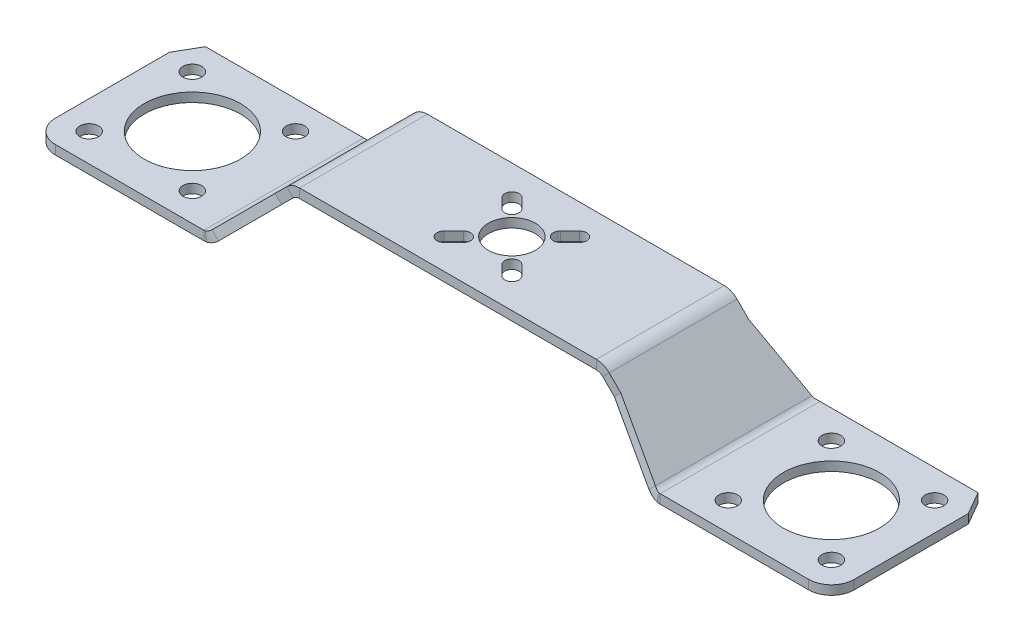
ISO-10303-21;
HEADER;
FILE_DESCRIPTION(('STEP AP214'),'2;1');
FILE_NAME('part.step','',(''),(''),'','','');
FILE_SCHEMA(('AUTOMOTIVE_DESIGN { 1 0 10303 214 1 1 1 1 }'));
ENDSEC;
DATA;
#1=APPLICATION_CONTEXT('core data for automotive mechanical design processes');
#2=APPLICATION_PROTOCOL_DEFINITION('international standard','automotive_design',2000,#1);
#3=PRODUCT_CONTEXT('',#1,'mechanical');
#4=PRODUCT('Part','Part','',(#3));
#5=PRODUCT_RELATED_PRODUCT_CATEGORY('part','',(#4));
#6=PRODUCT_DEFINITION_FORMATION('','',#4);
#7=PRODUCT_DEFINITION_CONTEXT('part definition',#1,'design');
#8=PRODUCT_DEFINITION('design','',#6,#7);
#9=PRODUCT_DEFINITION_SHAPE('','',#8);
#10=(LENGTH_UNIT() NAMED_UNIT(*) SI_UNIT(.MILLI.,.METRE.));
#11=(NAMED_UNIT(*) PLANE_ANGLE_UNIT() SI_UNIT($,.RADIAN.));
#12=(NAMED_UNIT(*) SI_UNIT($,.STERADIAN.) SOLID_ANGLE_UNIT());
#13=UNCERTAINTY_MEASURE_WITH_UNIT(LENGTH_MEASURE(1.E-05),#10,'distance_accuracy_value','');
#14=(GEOMETRIC_REPRESENTATION_CONTEXT(3) GLOBAL_UNCERTAINTY_ASSIGNED_CONTEXT((#13)) GLOBAL_UNIT_ASSIGNED_CONTEXT((#10,
#11,#12)) REPRESENTATION_CONTEXT('',''));
#15=CARTESIAN_POINT('',(0.,0.,0.));
#16=DIRECTION('',(0.,0.,1.));
#17=DIRECTION('',(1.,0.,0.));
#18=AXIS2_PLACEMENT_3D('',#15,#16,#17);
#19=CARTESIAN_POINT('',(0.,-2.,0.));
#20=DIRECTION('',(0.,1.,0.));
#21=DIRECTION('',(0.,0.,1.));
#22=AXIS2_PLACEMENT_3D('',#19,#20,#21);
#23=PLANE('',#22);
#24=DIRECTION('',(0.707106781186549,0.,0.707106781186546));
#25=VECTOR('',#24,1.);
#26=CARTESIAN_POINT('',(-6.39931636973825,-2.,-4.20728534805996));
#27=LINE('',#26,#25);
#28=CARTESIAN_POINT('',(-8.5206367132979,-2.,-6.32860569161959));
#29=VERTEX_POINT('',#28);
#30=CARTESIAN_POINT('',(-6.39931636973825,-2.,-4.20728534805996));
#31=VERTEX_POINT('',#30);
#32=EDGE_CURVE('E1118',#29,#31,#27,.T.);
#33=ORIENTED_EDGE('',*,*,#32,.T.);
#34=CARTESIAN_POINT('',(-5.30330085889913,-2.,-5.30330085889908));
#35=DIRECTION('',(0.,1.,0.));
#36=DIRECTION('',(0.,0.,1.));
#37=AXIS2_PLACEMENT_3D('',#34,#35,#36);
#38=CIRCLE('',#37,1.54999999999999);
#39=CARTESIAN_POINT('',(-4.20728534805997,-2.,-6.39931636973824));
#40=VERTEX_POINT('',#39);
#41=EDGE_CURVE('E1115',#31,#40,#38,.T.);
#42=ORIENTED_EDGE('',*,*,#41,.T.);
#43=DIRECTION('',(-0.707106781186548,0.,-0.707106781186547));
#44=VECTOR('',#43,1.);
#45=CARTESIAN_POINT('',(-4.20728534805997,-2.,-6.39931636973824));
#46=LINE('',#45,#44);
#47=CARTESIAN_POINT('',(-6.3286056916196,-2.,-8.52063671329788));
#48=VERTEX_POINT('',#47);
#49=EDGE_CURVE('E1112',#40,#48,#46,.T.);
#50=ORIENTED_EDGE('',*,*,#49,.T.);
#51=CARTESIAN_POINT('',(-7.42462120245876,-2.,-7.42462120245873));
#52=DIRECTION('',(0.,1.,0.));
#53=DIRECTION('',(0.,0.,1.));
#54=AXIS2_PLACEMENT_3D('',#51,#52,#53);
#55=CIRCLE('',#54,1.54999999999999);
#56=EDGE_CURVE('E1003',#48,#29,#55,.T.);
#57=ORIENTED_EDGE('',*,*,#56,.T.);
#58=EDGE_LOOP('',(#33,#42,#50,#57));
#59=FACE_BOUND('',#58,.T.);
#60=DIRECTION('',(0.707106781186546,0.,-0.707106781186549));
#61=VECTOR('',#60,1.);
#62=CARTESIAN_POINT('',(-4.20728534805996,-2.,6.39931636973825));
#63=LINE('',#62,#61);
#64=CARTESIAN_POINT('',(-6.32860569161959,-2.,8.5206367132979));
#65=VERTEX_POINT('',#64);
#66=CARTESIAN_POINT('',(-4.20728534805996,-2.,6.39931636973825));
#67=VERTEX_POINT('',#66);
#68=EDGE_CURVE('E1129',#65,#67,#63,.T.);
#69=ORIENTED_EDGE('',*,*,#68,.T.);
#70=CARTESIAN_POINT('',(-5.30330085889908,-2.,5.30330085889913));
#71=DIRECTION('',(0.,1.,0.));
#72=DIRECTION('',(0.,0.,1.));
#73=AXIS2_PLACEMENT_3D('',#70,#71,#72);
#74=CIRCLE('',#73,1.54999999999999);
#75=CARTESIAN_POINT('',(-6.39931636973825,-2.,4.20728534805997));
#76=VERTEX_POINT('',#75);
#77=EDGE_CURVE('E1126',#67,#76,#74,.T.);
#78=ORIENTED_EDGE('',*,*,#77,.T.);
#79=DIRECTION('',(-0.707106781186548,0.,0.707106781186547));
#80=VECTOR('',#79,1.);
#81=CARTESIAN_POINT('',(-6.39931636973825,-2.,4.20728534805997));
#82=LINE('',#81,#80);
#83=CARTESIAN_POINT('',(-8.52063671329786,-2.,6.32860569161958));
#84=VERTEX_POINT('',#83);
#85=EDGE_CURVE('E1123',#76,#84,#82,.T.);
#86=ORIENTED_EDGE('',*,*,#85,.T.);
#87=CARTESIAN_POINT('',(-7.42462120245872,-2.,7.42462120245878));
#88=DIRECTION('',(0.,1.,0.));
#89=DIRECTION('',(0.,0.,1.));
#90=AXIS2_PLACEMENT_3D('',#87,#88,#89);
#91=CIRCLE('',#90,1.55);
#92=EDGE_CURVE('E1120',#84,#65,#91,.T.);
#93=ORIENTED_EDGE('',*,*,#92,.T.);
#94=EDGE_LOOP('',(#69,#78,#86,#93));
#95=FACE_BOUND('',#94,.T.);
#96=DIRECTION('',(-0.707106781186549,0.,-0.707106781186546));
#97=VECTOR('',#96,1.);
#98=CARTESIAN_POINT('',(6.39931636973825,-2.,4.20728534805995));
#99=LINE('',#98,#97);
#100=CARTESIAN_POINT('',(8.5206367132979,-2.,6.32860569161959));
#101=VERTEX_POINT('',#100);
#102=CARTESIAN_POINT('',(6.39931636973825,-2.,4.20728534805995));
#103=VERTEX_POINT('',#102);
#104=EDGE_CURVE('E1141',#101,#103,#99,.T.);
#105=ORIENTED_EDGE('',*,*,#104,.T.);
#106=CARTESIAN_POINT('',(5.30330085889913,-2.,5.30330085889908));
#107=DIRECTION('',(0.,1.,0.));
#108=DIRECTION('',(0.,0.,1.));
#109=AXIS2_PLACEMENT_3D('',#106,#107,#108);
#110=CIRCLE('',#109,1.54999999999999);
#111=CARTESIAN_POINT('',(4.20728534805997,-2.,6.39931636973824));
#112=VERTEX_POINT('',#111);
#113=EDGE_CURVE('E1138',#103,#112,#110,.T.);
#114=ORIENTED_EDGE('',*,*,#113,.T.);
#115=DIRECTION('',(0.707106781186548,0.,0.707106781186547));
#116=VECTOR('',#115,1.);
#117=CARTESIAN_POINT('',(4.20728534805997,-2.,6.39931636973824));
#118=LINE('',#117,#116);
#119=CARTESIAN_POINT('',(6.3286056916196,-2.,8.52063671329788));
#120=VERTEX_POINT('',#119);
#121=EDGE_CURVE('E1135',#112,#120,#118,.T.);
#122=ORIENTED_EDGE('',*,*,#121,.T.);
#123=CARTESIAN_POINT('',(7.42462120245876,-2.,7.42462120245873));
#124=DIRECTION('',(0.,1.,0.));
#125=DIRECTION('',(0.,0.,1.));
#126=AXIS2_PLACEMENT_3D('',#123,#124,#125);
#127=CIRCLE('',#126,1.55);
#128=EDGE_CURVE('E1132',#120,#101,#127,.T.);
#129=ORIENTED_EDGE('',*,*,#128,.T.);
#130=EDGE_LOOP('',(#105,#114,#122,#129));
#131=FACE_BOUND('',#130,.T.);
#132=DIRECTION('',(-0.70710678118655,0.,0.707106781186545));
#133=VECTOR('',#132,1.);
#134=CARTESIAN_POINT('',(4.20728534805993,-2.,-6.39931636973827));
#135=LINE('',#134,#133);
#136=CARTESIAN_POINT('',(6.32860569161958,-2.,-8.52063671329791));
#137=VERTEX_POINT('',#136);
#138=CARTESIAN_POINT('',(4.20728534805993,-2.,-6.39931636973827));
#139=VERTEX_POINT('',#138);
#140=EDGE_CURVE('E1153',#137,#139,#135,.T.);
#141=ORIENTED_EDGE('',*,*,#140,.T.);
#142=CARTESIAN_POINT('',(5.30330085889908,-2.,-5.30330085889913));
#143=DIRECTION('',(0.,1.,0.));
#144=DIRECTION('',(0.,0.,1.));
#145=AXIS2_PLACEMENT_3D('',#142,#143,#144);
#146=CIRCLE('',#145,1.55);
#147=CARTESIAN_POINT('',(6.39931636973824,-2.,-4.20728534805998));
#148=VERTEX_POINT('',#147);
#149=EDGE_CURVE('E1150',#139,#148,#146,.T.);
#150=ORIENTED_EDGE('',*,*,#149,.T.);
#151=DIRECTION('',(0.707106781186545,0.,-0.70710678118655));
#152=VECTOR('',#151,1.);
#153=CARTESIAN_POINT('',(6.39931636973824,-2.,-4.20728534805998));
#154=LINE('',#153,#152);
#155=CARTESIAN_POINT('',(8.52063671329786,-2.,-6.32860569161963));
#156=VERTEX_POINT('',#155);
#157=EDGE_CURVE('E1147',#148,#156,#154,.T.);
#158=ORIENTED_EDGE('',*,*,#157,.T.);
#159=CARTESIAN_POINT('',(7.42462120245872,-2.,-7.42462120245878));
#160=DIRECTION('',(0.,1.,0.));
#161=DIRECTION('',(0.,0.,1.));
#162=AXIS2_PLACEMENT_3D('',#159,#160,#161);
#163=CIRCLE('',#162,1.54999999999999);
#164=EDGE_CURVE('E1144',#156,#137,#163,.T.);
#165=ORIENTED_EDGE('',*,*,#164,.T.);
#166=EDGE_LOOP('',(#141,#150,#158,#165));
#167=FACE_BOUND('',#166,.T.);
#168=CARTESIAN_POINT('',(0.,-2.,0.));
#169=DIRECTION('',(0.,1.,0.));
#170=DIRECTION('',(0.,0.,1.));
#171=AXIS2_PLACEMENT_3D('',#168,#169,#170);
#172=CIRCLE('',#171,5.15);
#173=CARTESIAN_POINT('',(0.,-2.,5.15));
#174=VERTEX_POINT('',#173);
#175=EDGE_CURVE('E1156',#174,#174,#172,.T.);
#176=ORIENTED_EDGE('',*,*,#175,.T.);
#177=EDGE_LOOP('',(#176));
#178=FACE_BOUND('',#177,.T.);
#179=DIRECTION('',(1.,0.,0.));
#180=VECTOR('',#179,1.);
#181=CARTESIAN_POINT('',(-32.5,-2.,14.));
#182=LINE('',#181,#180);
#183=CARTESIAN_POINT('',(-32.5,-2.,14.));
#184=VERTEX_POINT('',#183);
#185=CARTESIAN_POINT('',(32.5,-2.,14.));
#186=VERTEX_POINT('',#185);
#187=EDGE_CURVE('E1001',#184,#186,#182,.T.);
#188=ORIENTED_EDGE('',*,*,#187,.F.);
#189=DIRECTION('',(0.,0.,-1.));
#190=VECTOR('',#189,1.);
#191=CARTESIAN_POINT('',(-32.5,-2.,0.));
#192=LINE('',#191,#190);
#193=CARTESIAN_POINT('',(-32.5,-2.,-14.));
#194=VERTEX_POINT('',#193);
#195=EDGE_CURVE('E977',#184,#194,#192,.T.);
#196=ORIENTED_EDGE('',*,*,#195,.T.);
#197=DIRECTION('',(-1.,0.,0.));
#198=VECTOR('',#197,1.);
#199=CARTESIAN_POINT('',(-32.5,-2.,-14.));
#200=LINE('',#199,#198);
#201=CARTESIAN_POINT('',(32.5,-2.,-14.));
#202=VERTEX_POINT('',#201);
#203=EDGE_CURVE('E991',#202,#194,#200,.T.);
#204=ORIENTED_EDGE('',*,*,#203,.F.);
#205=DIRECTION('',(0.,0.,-1.));
#206=VECTOR('',#205,1.);
#207=CARTESIAN_POINT('',(32.5,-2.,0.));
#208=LINE('',#207,#206);
#209=EDGE_CURVE('E1242',#186,#202,#208,.T.);
#210=ORIENTED_EDGE('',*,*,#209,.F.);
#211=EDGE_LOOP('',(#188,#196,#204,#210));
#212=FACE_BOUND('',#211,.T.);
#213=ADVANCED_FACE('F76',(#59,#95,#131,#167,#178,#212),#23,.F.);
#214=CARTESIAN_POINT('',(36.4589743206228,-5.13054719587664,14.));
#215=DIRECTION('',(-0.142590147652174,0.142590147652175,0.979457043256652));
#216=DIRECTION('',(0.692580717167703,-0.692580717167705,0.201652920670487));
#217=AXIS2_PLACEMENT_3D('',#214,#215,#216);
#218=PLANE('',#217);
#219=DIRECTION('',(0.692580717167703,-0.692580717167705,0.201652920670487));
#220=VECTOR('',#219,1.);
#221=CARTESIAN_POINT('',(36.4589743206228,-5.13054719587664,14.));
#222=LINE('',#221,#220);
#223=CARTESIAN_POINT('',(36.4589743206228,-5.13054719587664,14.));
#224=VERTEX_POINT('',#223);
#225=CARTESIAN_POINT('',(47.1568542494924,-15.8284271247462,17.1148120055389));
#226=VERTEX_POINT('',#225);
#227=EDGE_CURVE('E1251',#224,#226,#222,.T.);
#228=ORIENTED_EDGE('',*,*,#227,.T.);
#229=CARTESIAN_POINT('',(48.5710678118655,-14.4142135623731,17.1148120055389));
#230=CARTESIAN_POINT('',(47.1568542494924,-15.8284271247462,17.1148120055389));
#231=B_SPLINE_CURVE_WITH_KNOTS('',1,(#229,#230),.UNSPECIFIED.,.F.,.F.,(2,2),(0.,1.),.UNSPECIFIED.);
#232=CARTESIAN_POINT('',(48.5710678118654,-14.4142135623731,17.1148120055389));
#233=VERTEX_POINT('',#232);
#234=EDGE_CURVE('E981',#226,#233,#231,.F.);
#235=ORIENTED_EDGE('',*,*,#234,.T.);
#236=DIRECTION('',(0.692580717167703,-0.692580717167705,0.201652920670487));
#237=VECTOR('',#236,1.);
#238=CARTESIAN_POINT('',(37.8731878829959,-3.71633363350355,14.));
#239=LINE('',#238,#237);
#240=CARTESIAN_POINT('',(37.8731878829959,-3.71633363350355,14.));
#241=VERTEX_POINT('',#240);
#242=EDGE_CURVE('E974',#241,#233,#239,.T.);
#243=ORIENTED_EDGE('',*,*,#242,.F.);
#244=DIRECTION('',(0.707106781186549,0.707106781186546,0.));
#245=VECTOR('',#244,1.);
#246=CARTESIAN_POINT('',(36.4589743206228,-5.13054719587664,14.));
#247=LINE('',#246,#245);
#248=EDGE_CURVE('E973',#224,#241,#247,.T.);
#249=ORIENTED_EDGE('',*,*,#248,.F.);
#250=EDGE_LOOP('',(#228,#235,#243,#249));
#251=FACE_BOUND('',#250,.T.);
#252=ADVANCED_FACE('F955',(#251),#218,.T.);
#253=CARTESIAN_POINT('',(36.4589743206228,-5.13054719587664,-14.));
#254=DIRECTION('',(-0.142590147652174,0.142590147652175,-0.979457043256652));
#255=DIRECTION('',(-0.692580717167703,0.692580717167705,0.201652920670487));
#256=AXIS2_PLACEMENT_3D('',#253,#254,#255);
#257=PLANE('',#256);
#258=DIRECTION('',(-0.692580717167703,0.692580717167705,0.201652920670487));
#259=VECTOR('',#258,1.);
#260=CARTESIAN_POINT('',(37.8731878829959,-3.71633363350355,-14.));
#261=LINE('',#260,#259);
#262=CARTESIAN_POINT('',(48.5710678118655,-14.4142135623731,-17.1148120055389));
#263=VERTEX_POINT('',#262);
#264=CARTESIAN_POINT('',(37.8731878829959,-3.71633363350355,-14.));
#265=VERTEX_POINT('',#264);
#266=EDGE_CURVE('E966',#263,#265,#261,.T.);
#267=ORIENTED_EDGE('',*,*,#266,.F.);
#268=CARTESIAN_POINT('',(47.1568542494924,-15.8284271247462,-17.1148120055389));
#269=CARTESIAN_POINT('',(48.5710678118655,-14.4142135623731,-17.1148120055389));
#270=B_SPLINE_CURVE_WITH_KNOTS('',1,(#268,#269),.UNSPECIFIED.,.F.,.F.,(2,2),(0.,1.),.UNSPECIFIED.);
#271=CARTESIAN_POINT('',(47.1568542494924,-15.8284271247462,-17.1148120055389));
#272=VERTEX_POINT('',#271);
#273=EDGE_CURVE('E1275',#263,#272,#270,.F.);
#274=ORIENTED_EDGE('',*,*,#273,.T.);
#275=DIRECTION('',(-0.692580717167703,0.692580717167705,0.201652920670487));
#276=VECTOR('',#275,1.);
#277=CARTESIAN_POINT('',(36.4589743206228,-5.13054719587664,-14.));
#278=LINE('',#277,#276);
#279=CARTESIAN_POINT('',(36.4589743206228,-5.13054719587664,-14.));
#280=VERTEX_POINT('',#279);
#281=EDGE_CURVE('E993',#272,#280,#278,.T.);
#282=ORIENTED_EDGE('',*,*,#281,.T.);
#283=DIRECTION('',(0.707106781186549,0.707106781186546,0.));
#284=VECTOR('',#283,1.);
#285=CARTESIAN_POINT('',(36.4589743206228,-5.13054719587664,-14.));
#286=LINE('',#285,#284);
#287=EDGE_CURVE('E1248',#280,#265,#286,.T.);
#288=ORIENTED_EDGE('',*,*,#287,.T.);
#289=EDGE_LOOP('',(#267,#274,#282,#288));
#290=FACE_BOUND('',#289,.T.);
#291=ADVANCED_FACE('F950',(#290),#257,.T.);
#292=CARTESIAN_POINT('',(10.681375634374,23.4754786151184,0.));
#293=DIRECTION('',(0.707106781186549,0.707106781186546,0.));
#294=DIRECTION('',(0.,0.,1.));
#295=AXIS2_PLACEMENT_3D('',#292,#293,#294);
#296=PLANE('',#295);
#297=ORIENTED_EDGE('',*,*,#242,.T.);
#298=DIRECTION('',(0.,0.,-1.));
#299=VECTOR('',#298,1.);
#300=CARTESIAN_POINT('',(48.5710678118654,-14.4142135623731,0.));
#301=LINE('',#300,#299);
#302=EDGE_CURVE('E1272',#233,#263,#301,.T.);
#303=ORIENTED_EDGE('',*,*,#302,.T.);
#304=ORIENTED_EDGE('',*,*,#266,.T.);
#305=DIRECTION('',(-0.707106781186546,0.707106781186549,0.));
#306=VECTOR('',#305,1.);
#307=CARTESIAN_POINT('',(-12.2995947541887,46.4564490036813,-14.));
#308=LINE('',#307,#306);
#309=CARTESIAN_POINT('',(35.3284271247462,-1.17157287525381,-14.));
#310=VERTEX_POINT('',#309);
#311=EDGE_CURVE('E1267',#265,#310,#308,.T.);
#312=ORIENTED_EDGE('',*,*,#311,.T.);
#313=DIRECTION('',(0.,0.,-1.));
#314=VECTOR('',#313,1.);
#315=CARTESIAN_POINT('',(35.3284271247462,-1.17157287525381,0.));
#316=LINE('',#315,#314);
#317=CARTESIAN_POINT('',(35.3284271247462,-1.17157287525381,14.));
#318=VERTEX_POINT('',#317);
#319=EDGE_CURVE('E1258',#318,#310,#316,.T.);
#320=ORIENTED_EDGE('',*,*,#319,.F.);
#321=DIRECTION('',(0.707106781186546,-0.707106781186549,0.));
#322=VECTOR('',#321,1.);
#323=CARTESIAN_POINT('',(-12.2995947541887,46.4564490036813,14.));
#324=LINE('',#323,#322);
#325=EDGE_CURVE('E1247',#318,#241,#324,.T.);
#326=ORIENTED_EDGE('',*,*,#325,.T.);
#327=EDGE_LOOP('',(#297,#303,#304,#312,#320,#326));
#328=FACE_BOUND('',#327,.T.);
#329=ADVANCED_FACE('F954',(#328),#296,.T.);
#330=CARTESIAN_POINT('',(9.26716207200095,22.0612650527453,0.));
#331=DIRECTION('',(0.707106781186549,0.707106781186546,0.));
#332=DIRECTION('',(0.,0.,1.));
#333=AXIS2_PLACEMENT_3D('',#330,#331,#332);
#334=PLANE('',#333);
#335=DIRECTION('',(0.,0.,-1.));
#336=VECTOR('',#335,1.);
#337=CARTESIAN_POINT('',(47.1568542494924,-15.8284271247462,0.));
#338=LINE('',#337,#336);
#339=EDGE_CURVE('E1263',#226,#272,#338,.T.);
#340=ORIENTED_EDGE('',*,*,#339,.F.);
#341=ORIENTED_EDGE('',*,*,#227,.F.);
#342=DIRECTION('',(0.707106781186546,-0.707106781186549,0.));
#343=VECTOR('',#342,1.);
#344=CARTESIAN_POINT('',(-13.7138083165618,45.0422354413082,14.));
#345=LINE('',#344,#343);
#346=CARTESIAN_POINT('',(33.9142135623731,-2.58578643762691,14.));
#347=VERTEX_POINT('',#346);
#348=EDGE_CURVE('E1266',#347,#224,#345,.T.);
#349=ORIENTED_EDGE('',*,*,#348,.F.);
#350=DIRECTION('',(0.,0.,-1.));
#351=VECTOR('',#350,1.);
#352=CARTESIAN_POINT('',(33.9142135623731,-2.58578643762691,0.));
#353=LINE('',#352,#351);
#354=CARTESIAN_POINT('',(33.9142135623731,-2.58578643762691,-14.));
#355=VERTEX_POINT('',#354);
#356=EDGE_CURVE('E1252',#347,#355,#353,.T.);
#357=ORIENTED_EDGE('',*,*,#356,.T.);
#358=DIRECTION('',(-0.707106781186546,0.707106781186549,0.));
#359=VECTOR('',#358,1.);
#360=CARTESIAN_POINT('',(-13.7138083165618,45.0422354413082,-14.));
#361=LINE('',#360,#359);
#362=EDGE_CURVE('E1256',#280,#355,#361,.T.);
#363=ORIENTED_EDGE('',*,*,#362,.F.);
#364=ORIENTED_EDGE('',*,*,#281,.F.);
#365=EDGE_LOOP('',(#340,#341,#349,#357,#363,#364));
#366=FACE_BOUND('',#365,.T.);
#367=ADVANCED_FACE('F945',(#366),#334,.F.);
#368=CARTESIAN_POINT('',(-13.7138083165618,45.0422354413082,14.));
#369=DIRECTION('',(0.,0.,1.));
#370=DIRECTION('',(0.707106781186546,-0.707106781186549,0.));
#371=AXIS2_PLACEMENT_3D('',#368,#369,#370);
#372=PLANE('',#371);
#373=DIRECTION('',(0.707106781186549,0.707106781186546,0.));
#374=VECTOR('',#373,1.);
#375=CARTESIAN_POINT('',(33.9142135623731,-2.58578643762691,14.));
#376=LINE('',#375,#374);
#377=EDGE_CURVE('E1255',#347,#318,#376,.T.);
#378=ORIENTED_EDGE('',*,*,#377,.F.);
#379=ORIENTED_EDGE('',*,*,#348,.T.);
#380=ORIENTED_EDGE('',*,*,#248,.T.);
#381=ORIENTED_EDGE('',*,*,#325,.F.);
#382=EDGE_LOOP('',(#378,#379,#380,#381));
#383=FACE_BOUND('',#382,.T.);
#384=ADVANCED_FACE('F942',(#383),#372,.T.);
#385=CARTESIAN_POINT('',(-13.7138083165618,45.0422354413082,-14.));
#386=DIRECTION('',(0.,0.,-1.));
#387=DIRECTION('',(-0.707106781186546,0.707106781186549,0.));
#388=AXIS2_PLACEMENT_3D('',#385,#386,#387);
#389=PLANE('',#388);
#390=DIRECTION('',(-0.707106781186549,-0.707106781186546,0.));
#391=VECTOR('',#390,1.);
#392=CARTESIAN_POINT('',(33.9142135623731,-2.58578643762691,-14.));
#393=LINE('',#392,#391);
#394=EDGE_CURVE('E1260',#310,#355,#393,.T.);
#395=ORIENTED_EDGE('',*,*,#394,.F.);
#396=ORIENTED_EDGE('',*,*,#311,.F.);
#397=ORIENTED_EDGE('',*,*,#287,.F.);
#398=ORIENTED_EDGE('',*,*,#362,.T.);
#399=EDGE_LOOP('',(#395,#396,#397,#398));
#400=FACE_BOUND('',#399,.T.);
#401=ADVANCED_FACE('F876',(#400),#389,.T.);
#402=CARTESIAN_POINT('',(-7.42462120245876,-2.,-7.42462120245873));
#403=DIRECTION('',(0.,1.,0.));
#404=DIRECTION('',(0.,0.,1.));
#405=AXIS2_PLACEMENT_3D('',#402,#403,#404);
#406=CYLINDRICAL_SURFACE('',#405,1.54999999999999);
#407=CARTESIAN_POINT('',(-7.42462120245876,0.,-7.42462120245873));
#408=DIRECTION('',(0.,1.,0.));
#409=DIRECTION('',(0.,0.,1.));
#410=AXIS2_PLACEMENT_3D('',#407,#408,#409);
#411=CIRCLE('',#410,1.54999999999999);
#412=CARTESIAN_POINT('',(-6.32860569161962,0.,-8.52063671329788));
#413=VERTEX_POINT('',#412);
#414=CARTESIAN_POINT('',(-8.5206367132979,0.,-6.32860569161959));
#415=VERTEX_POINT('',#414);
#416=EDGE_CURVE('E1239',#413,#415,#411,.T.);
#417=ORIENTED_EDGE('',*,*,#416,.T.);
#418=DIRECTION('',(0.,1.,0.));
#419=VECTOR('',#418,1.);
#420=CARTESIAN_POINT('',(-8.5206367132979,-2.,-6.32860569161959));
#421=LINE('',#420,#419);
#422=EDGE_CURVE('E1222',#29,#415,#421,.T.);
#423=ORIENTED_EDGE('',*,*,#422,.F.);
#424=ORIENTED_EDGE('',*,*,#56,.F.);
#425=DIRECTION('',(0.,1.,0.));
#426=VECTOR('',#425,1.);
#427=CARTESIAN_POINT('',(-6.32860569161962,-2.,-8.52063671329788));
#428=LINE('',#427,#426);
#429=EDGE_CURVE('E1237',#48,#413,#428,.T.);
#430=ORIENTED_EDGE('',*,*,#429,.T.);
#431=EDGE_LOOP('',(#417,#423,#424,#430));
#432=FACE_BOUND('',#431,.T.);
#433=ADVANCED_FACE('F872',(#432),#406,.F.);
#434=CARTESIAN_POINT('',(-4.20728534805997,-2.,-6.39931636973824));
#435=DIRECTION('',(0.707106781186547,0.,-0.707106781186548));
#436=DIRECTION('',(-0.707106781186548,0.,-0.707106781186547));
#437=AXIS2_PLACEMENT_3D('',#434,#435,#436);
#438=PLANE('',#437);
#439=DIRECTION('',(-0.707106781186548,0.,-0.707106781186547));
#440=VECTOR('',#439,1.);
#441=CARTESIAN_POINT('',(-4.20728534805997,0.,-6.39931636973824));
#442=LINE('',#441,#440);
#443=CARTESIAN_POINT('',(-4.20728534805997,0.,-6.39931636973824));
#444=VERTEX_POINT('',#443);
#445=EDGE_CURVE('E1234',#444,#413,#442,.T.);
#446=ORIENTED_EDGE('',*,*,#445,.T.);
#447=ORIENTED_EDGE('',*,*,#429,.F.);
#448=ORIENTED_EDGE('',*,*,#49,.F.);
#449=DIRECTION('',(0.,1.,0.));
#450=VECTOR('',#449,1.);
#451=CARTESIAN_POINT('',(-4.20728534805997,-2.,-6.39931636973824));
#452=LINE('',#451,#450);
#453=EDGE_CURVE('E1231',#40,#444,#452,.T.);
#454=ORIENTED_EDGE('',*,*,#453,.T.);
#455=EDGE_LOOP('',(#446,#447,#448,#454));
#456=FACE_BOUND('',#455,.T.);
#457=ADVANCED_FACE('F875',(#456),#438,.F.);
#458=CARTESIAN_POINT('',(-5.30330085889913,-2.,-5.30330085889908));
#459=DIRECTION('',(0.,1.,0.));
#460=DIRECTION('',(0.,0.,1.));
#461=AXIS2_PLACEMENT_3D('',#458,#459,#460);
#462=CYLINDRICAL_SURFACE('',#461,1.54999999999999);
#463=CARTESIAN_POINT('',(-5.30330085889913,0.,-5.30330085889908));
#464=DIRECTION('',(0.,1.,0.));
#465=DIRECTION('',(0.,0.,1.));
#466=AXIS2_PLACEMENT_3D('',#463,#464,#465);
#467=CIRCLE('',#466,1.54999999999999);
#468=CARTESIAN_POINT('',(-6.39931636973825,0.,-4.20728534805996));
#469=VERTEX_POINT('',#468);
#470=EDGE_CURVE('E1229',#469,#444,#467,.T.);
#471=ORIENTED_EDGE('',*,*,#470,.T.);
#472=ORIENTED_EDGE('',*,*,#453,.F.);
#473=ORIENTED_EDGE('',*,*,#41,.F.);
#474=DIRECTION('',(0.,1.,0.));
#475=VECTOR('',#474,1.);
#476=CARTESIAN_POINT('',(-6.39931636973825,-2.,-4.20728534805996));
#477=LINE('',#476,#475);
#478=EDGE_CURVE('E1227',#31,#469,#477,.T.);
#479=ORIENTED_EDGE('',*,*,#478,.T.);
#480=EDGE_LOOP('',(#471,#472,#473,#479));
#481=FACE_BOUND('',#480,.T.);
#482=ADVANCED_FACE('F880',(#481),#462,.F.);
#483=CARTESIAN_POINT('',(-6.39931636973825,-2.,-4.20728534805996));
#484=DIRECTION('',(-0.707106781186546,0.,0.707106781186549));
#485=DIRECTION('',(0.707106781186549,0.,0.707106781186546));
#486=AXIS2_PLACEMENT_3D('',#483,#484,#485);
#487=PLANE('',#486);
#488=DIRECTION('',(0.707106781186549,0.,0.707106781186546));
#489=VECTOR('',#488,1.);
#490=CARTESIAN_POINT('',(-6.39931636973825,0.,-4.20728534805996));
#491=LINE('',#490,#489);
#492=EDGE_CURVE('E1224',#415,#469,#491,.T.);
#493=ORIENTED_EDGE('',*,*,#492,.T.);
#494=ORIENTED_EDGE('',*,*,#478,.F.);
#495=ORIENTED_EDGE('',*,*,#32,.F.);
#496=ORIENTED_EDGE('',*,*,#422,.T.);
#497=EDGE_LOOP('',(#493,#494,#495,#496));
#498=FACE_BOUND('',#497,.T.);
#499=ADVANCED_FACE('F884',(#498),#487,.F.);
#500=CARTESIAN_POINT('',(-7.42462120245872,-2.,7.42462120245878));
#501=DIRECTION('',(0.,1.,0.));
#502=DIRECTION('',(0.,0.,1.));
#503=AXIS2_PLACEMENT_3D('',#500,#501,#502);
#504=CYLINDRICAL_SURFACE('',#503,1.55);
#505=CARTESIAN_POINT('',(-7.42462120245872,0.,7.42462120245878));
#506=DIRECTION('',(0.,1.,0.));
#507=DIRECTION('',(0.,0.,1.));
#508=AXIS2_PLACEMENT_3D('',#505,#506,#507);
#509=CIRCLE('',#508,1.55);
#510=CARTESIAN_POINT('',(-8.52063671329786,0.,6.32860569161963));
#511=VERTEX_POINT('',#510);
#512=CARTESIAN_POINT('',(-6.32860569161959,0.,8.5206367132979));
#513=VERTEX_POINT('',#512);
#514=EDGE_CURVE('E1219',#511,#513,#509,.T.);
#515=ORIENTED_EDGE('',*,*,#514,.T.);
#516=DIRECTION('',(0.,1.,0.));
#517=VECTOR('',#516,1.);
#518=CARTESIAN_POINT('',(-6.32860569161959,-2.,8.5206367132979));
#519=LINE('',#518,#517);
#520=EDGE_CURVE('E1202',#65,#513,#519,.T.);
#521=ORIENTED_EDGE('',*,*,#520,.F.);
#522=ORIENTED_EDGE('',*,*,#92,.F.);
#523=DIRECTION('',(0.,1.,0.));
#524=VECTOR('',#523,1.);
#525=CARTESIAN_POINT('',(-8.52063671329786,-2.,6.32860569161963));
#526=LINE('',#525,#524);
#527=EDGE_CURVE('E1217',#84,#511,#526,.T.);
#528=ORIENTED_EDGE('',*,*,#527,.T.);
#529=EDGE_LOOP('',(#515,#521,#522,#528));
#530=FACE_BOUND('',#529,.T.);
#531=ADVANCED_FACE('F888',(#530),#504,.F.);
#532=CARTESIAN_POINT('',(-6.39931636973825,-2.,4.20728534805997));
#533=DIRECTION('',(-0.707106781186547,0.,-0.707106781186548));
#534=DIRECTION('',(-0.707106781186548,0.,0.707106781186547));
#535=AXIS2_PLACEMENT_3D('',#532,#533,#534);
#536=PLANE('',#535);
#537=DIRECTION('',(-0.707106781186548,0.,0.707106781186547));
#538=VECTOR('',#537,1.);
#539=CARTESIAN_POINT('',(-6.39931636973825,0.,4.20728534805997));
#540=LINE('',#539,#538);
#541=CARTESIAN_POINT('',(-6.39931636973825,0.,4.20728534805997));
#542=VERTEX_POINT('',#541);
#543=EDGE_CURVE('E1214',#542,#511,#540,.T.);
#544=ORIENTED_EDGE('',*,*,#543,.T.);
#545=ORIENTED_EDGE('',*,*,#527,.F.);
#546=ORIENTED_EDGE('',*,*,#85,.F.);
#547=DIRECTION('',(0.,1.,0.));
#548=VECTOR('',#547,1.);
#549=CARTESIAN_POINT('',(-6.39931636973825,-2.,4.20728534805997));
#550=LINE('',#549,#548);
#551=EDGE_CURVE('E1211',#76,#542,#550,.T.);
#552=ORIENTED_EDGE('',*,*,#551,.T.);
#553=EDGE_LOOP('',(#544,#545,#546,#552));
#554=FACE_BOUND('',#553,.T.);
#555=ADVANCED_FACE('F892',(#554),#536,.F.);
#556=CARTESIAN_POINT('',(-5.30330085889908,-2.,5.30330085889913));
#557=DIRECTION('',(0.,1.,0.));
#558=DIRECTION('',(0.,0.,1.));
#559=AXIS2_PLACEMENT_3D('',#556,#557,#558);
#560=CYLINDRICAL_SURFACE('',#559,1.54999999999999);
#561=CARTESIAN_POINT('',(-5.30330085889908,0.,5.30330085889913));
#562=DIRECTION('',(0.,1.,0.));
#563=DIRECTION('',(0.,0.,1.));
#564=AXIS2_PLACEMENT_3D('',#561,#562,#563);
#565=CIRCLE('',#564,1.54999999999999);
#566=CARTESIAN_POINT('',(-4.20728534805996,0.,6.39931636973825));
#567=VERTEX_POINT('',#566);
#568=EDGE_CURVE('E1209',#567,#542,#565,.T.);
#569=ORIENTED_EDGE('',*,*,#568,.T.);
#570=ORIENTED_EDGE('',*,*,#551,.F.);
#571=ORIENTED_EDGE('',*,*,#77,.F.);
#572=DIRECTION('',(0.,1.,0.));
#573=VECTOR('',#572,1.);
#574=CARTESIAN_POINT('',(-4.20728534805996,-2.,6.39931636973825));
#575=LINE('',#574,#573);
#576=EDGE_CURVE('E1207',#67,#567,#575,.T.);
#577=ORIENTED_EDGE('',*,*,#576,.T.);
#578=EDGE_LOOP('',(#569,#570,#571,#577));
#579=FACE_BOUND('',#578,.T.);
#580=ADVANCED_FACE('F896',(#579),#560,.F.);
#581=CARTESIAN_POINT('',(-4.20728534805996,-2.,6.39931636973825));
#582=DIRECTION('',(0.707106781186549,0.,0.707106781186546));
#583=DIRECTION('',(0.707106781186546,0.,-0.707106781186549));
#584=AXIS2_PLACEMENT_3D('',#581,#582,#583);
#585=PLANE('',#584);
#586=DIRECTION('',(0.707106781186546,0.,-0.707106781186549));
#587=VECTOR('',#586,1.);
#588=CARTESIAN_POINT('',(-4.20728534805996,0.,6.39931636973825));
#589=LINE('',#588,#587);
#590=EDGE_CURVE('E1204',#513,#567,#589,.T.);
#591=ORIENTED_EDGE('',*,*,#590,.T.);
#592=ORIENTED_EDGE('',*,*,#576,.F.);
#593=ORIENTED_EDGE('',*,*,#68,.F.);
#594=ORIENTED_EDGE('',*,*,#520,.T.);
#595=EDGE_LOOP('',(#591,#592,#593,#594));
#596=FACE_BOUND('',#595,.T.);
#597=ADVANCED_FACE('F900',(#596),#585,.F.);
#598=CARTESIAN_POINT('',(7.42462120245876,-2.,7.42462120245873));
#599=DIRECTION('',(0.,1.,0.));
#600=DIRECTION('',(0.,0.,1.));
#601=AXIS2_PLACEMENT_3D('',#598,#599,#600);
#602=CYLINDRICAL_SURFACE('',#601,1.55);
#603=CARTESIAN_POINT('',(7.42462120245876,0.,7.42462120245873));
#604=DIRECTION('',(0.,1.,0.));
#605=DIRECTION('',(0.,0.,1.));
#606=AXIS2_PLACEMENT_3D('',#603,#604,#605);
#607=CIRCLE('',#606,1.55);
#608=CARTESIAN_POINT('',(6.32860569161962,0.,8.52063671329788));
#609=VERTEX_POINT('',#608);
#610=CARTESIAN_POINT('',(8.5206367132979,0.,6.32860569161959));
#611=VERTEX_POINT('',#610);
#612=EDGE_CURVE('E1199',#609,#611,#607,.T.);
#613=ORIENTED_EDGE('',*,*,#612,.T.);
#614=DIRECTION('',(0.,1.,0.));
#615=VECTOR('',#614,1.);
#616=CARTESIAN_POINT('',(8.5206367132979,-2.,6.32860569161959));
#617=LINE('',#616,#615);
#618=EDGE_CURVE('E1182',#101,#611,#617,.T.);
#619=ORIENTED_EDGE('',*,*,#618,.F.);
#620=ORIENTED_EDGE('',*,*,#128,.F.);
#621=DIRECTION('',(0.,1.,0.));
#622=VECTOR('',#621,1.);
#623=CARTESIAN_POINT('',(6.32860569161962,-2.,8.52063671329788));
#624=LINE('',#623,#622);
#625=EDGE_CURVE('E1197',#120,#609,#624,.T.);
#626=ORIENTED_EDGE('',*,*,#625,.T.);
#627=EDGE_LOOP('',(#613,#619,#620,#626));
#628=FACE_BOUND('',#627,.T.);
#629=ADVANCED_FACE('F904',(#628),#602,.F.);
#630=CARTESIAN_POINT('',(4.20728534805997,-2.,6.39931636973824));
#631=DIRECTION('',(-0.707106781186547,0.,0.707106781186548));
#632=DIRECTION('',(0.707106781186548,0.,0.707106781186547));
#633=AXIS2_PLACEMENT_3D('',#630,#631,#632);
#634=PLANE('',#633);
#635=DIRECTION('',(0.707106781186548,0.,0.707106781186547));
#636=VECTOR('',#635,1.);
#637=CARTESIAN_POINT('',(4.20728534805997,0.,6.39931636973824));
#638=LINE('',#637,#636);
#639=CARTESIAN_POINT('',(4.20728534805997,0.,6.39931636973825));
#640=VERTEX_POINT('',#639);
#641=EDGE_CURVE('E1194',#640,#609,#638,.T.);
#642=ORIENTED_EDGE('',*,*,#641,.T.);
#643=ORIENTED_EDGE('',*,*,#625,.F.);
#644=ORIENTED_EDGE('',*,*,#121,.F.);
#645=DIRECTION('',(0.,1.,0.));
#646=VECTOR('',#645,1.);
#647=CARTESIAN_POINT('',(4.20728534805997,-2.,6.39931636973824));
#648=LINE('',#647,#646);
#649=EDGE_CURVE('E1191',#112,#640,#648,.T.);
#650=ORIENTED_EDGE('',*,*,#649,.T.);
#651=EDGE_LOOP('',(#642,#643,#644,#650));
#652=FACE_BOUND('',#651,.T.);
#653=ADVANCED_FACE('F908',(#652),#634,.F.);
#654=CARTESIAN_POINT('',(5.30330085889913,-2.,5.30330085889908));
#655=DIRECTION('',(0.,1.,0.));
#656=DIRECTION('',(0.,0.,1.));
#657=AXIS2_PLACEMENT_3D('',#654,#655,#656);
#658=CYLINDRICAL_SURFACE('',#657,1.54999999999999);
#659=CARTESIAN_POINT('',(5.30330085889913,0.,5.30330085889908));
#660=DIRECTION('',(0.,1.,0.));
#661=DIRECTION('',(0.,0.,1.));
#662=AXIS2_PLACEMENT_3D('',#659,#660,#661);
#663=CIRCLE('',#662,1.54999999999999);
#664=CARTESIAN_POINT('',(6.39931636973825,0.,4.20728534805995));
#665=VERTEX_POINT('',#664);
#666=EDGE_CURVE('E1189',#665,#640,#663,.T.);
#667=ORIENTED_EDGE('',*,*,#666,.T.);
#668=ORIENTED_EDGE('',*,*,#649,.F.);
#669=ORIENTED_EDGE('',*,*,#113,.F.);
#670=DIRECTION('',(0.,1.,0.));
#671=VECTOR('',#670,1.);
#672=CARTESIAN_POINT('',(6.39931636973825,-2.,4.20728534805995));
#673=LINE('',#672,#671);
#674=EDGE_CURVE('E1187',#103,#665,#673,.T.);
#675=ORIENTED_EDGE('',*,*,#674,.T.);
#676=EDGE_LOOP('',(#667,#668,#669,#675));
#677=FACE_BOUND('',#676,.T.);
#678=ADVANCED_FACE('F912',(#677),#658,.F.);
#679=CARTESIAN_POINT('',(6.39931636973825,-2.,4.20728534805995));
#680=DIRECTION('',(0.707106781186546,0.,-0.707106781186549));
#681=DIRECTION('',(-0.707106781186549,0.,-0.707106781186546));
#682=AXIS2_PLACEMENT_3D('',#679,#680,#681);
#683=PLANE('',#682);
#684=DIRECTION('',(-0.707106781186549,0.,-0.707106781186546));
#685=VECTOR('',#684,1.);
#686=CARTESIAN_POINT('',(6.39931636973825,0.,4.20728534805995));
#687=LINE('',#686,#685);
#688=EDGE_CURVE('E1184',#611,#665,#687,.T.);
#689=ORIENTED_EDGE('',*,*,#688,.T.);
#690=ORIENTED_EDGE('',*,*,#674,.F.);
#691=ORIENTED_EDGE('',*,*,#104,.F.);
#692=ORIENTED_EDGE('',*,*,#618,.T.);
#693=EDGE_LOOP('',(#689,#690,#691,#692));
#694=FACE_BOUND('',#693,.T.);
#695=ADVANCED_FACE('F916',(#694),#683,.F.);
#696=CARTESIAN_POINT('',(7.42462120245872,-2.,-7.42462120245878));
#697=DIRECTION('',(0.,1.,0.));
#698=DIRECTION('',(0.,0.,1.));
#699=AXIS2_PLACEMENT_3D('',#696,#697,#698);
#700=CYLINDRICAL_SURFACE('',#699,1.54999999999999);
#701=CARTESIAN_POINT('',(7.42462120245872,0.,-7.42462120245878));
#702=DIRECTION('',(0.,1.,0.));
#703=DIRECTION('',(0.,0.,1.));
#704=AXIS2_PLACEMENT_3D('',#701,#702,#703);
#705=CIRCLE('',#704,1.54999999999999);
#706=CARTESIAN_POINT('',(8.52063671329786,0.,-6.32860569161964));
#707=VERTEX_POINT('',#706);
#708=CARTESIAN_POINT('',(6.32860569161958,0.,-8.52063671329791));
#709=VERTEX_POINT('',#708);
#710=EDGE_CURVE('E1179',#707,#709,#705,.T.);
#711=ORIENTED_EDGE('',*,*,#710,.T.);
#712=DIRECTION('',(0.,1.,0.));
#713=VECTOR('',#712,1.);
#714=CARTESIAN_POINT('',(6.32860569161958,-2.,-8.52063671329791));
#715=LINE('',#714,#713);
#716=EDGE_CURVE('E1162',#137,#709,#715,.T.);
#717=ORIENTED_EDGE('',*,*,#716,.F.);
#718=ORIENTED_EDGE('',*,*,#164,.F.);
#719=DIRECTION('',(0.,1.,0.));
#720=VECTOR('',#719,1.);
#721=CARTESIAN_POINT('',(8.52063671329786,-2.,-6.32860569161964));
#722=LINE('',#721,#720);
#723=EDGE_CURVE('E1177',#156,#707,#722,.T.);
#724=ORIENTED_EDGE('',*,*,#723,.T.);
#725=EDGE_LOOP('',(#711,#717,#718,#724));
#726=FACE_BOUND('',#725,.T.);
#727=ADVANCED_FACE('F920',(#726),#700,.F.);
#728=CARTESIAN_POINT('',(6.39931636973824,-2.,-4.20728534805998));
#729=DIRECTION('',(0.70710678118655,0.,0.707106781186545));
#730=DIRECTION('',(0.707106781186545,0.,-0.70710678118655));
#731=AXIS2_PLACEMENT_3D('',#728,#729,#730);
#732=PLANE('',#731);
#733=DIRECTION('',(0.707106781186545,0.,-0.70710678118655));
#734=VECTOR('',#733,1.);
#735=CARTESIAN_POINT('',(6.39931636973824,0.,-4.20728534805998));
#736=LINE('',#735,#734);
#737=CARTESIAN_POINT('',(6.39931636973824,0.,-4.20728534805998));
#738=VERTEX_POINT('',#737);
#739=EDGE_CURVE('E1174',#738,#707,#736,.T.);
#740=ORIENTED_EDGE('',*,*,#739,.T.);
#741=ORIENTED_EDGE('',*,*,#723,.F.);
#742=ORIENTED_EDGE('',*,*,#157,.F.);
#743=DIRECTION('',(0.,1.,0.));
#744=VECTOR('',#743,1.);
#745=CARTESIAN_POINT('',(6.39931636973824,-2.,-4.20728534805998));
#746=LINE('',#745,#744);
#747=EDGE_CURVE('E1171',#148,#738,#746,.T.);
#748=ORIENTED_EDGE('',*,*,#747,.T.);
#749=EDGE_LOOP('',(#740,#741,#742,#748));
#750=FACE_BOUND('',#749,.T.);
#751=ADVANCED_FACE('F924',(#750),#732,.F.);
#752=CARTESIAN_POINT('',(5.30330085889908,-2.,-5.30330085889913));
#753=DIRECTION('',(0.,1.,0.));
#754=DIRECTION('',(0.,0.,1.));
#755=AXIS2_PLACEMENT_3D('',#752,#753,#754);
#756=CYLINDRICAL_SURFACE('',#755,1.55);
#757=CARTESIAN_POINT('',(5.30330085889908,0.,-5.30330085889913));
#758=DIRECTION('',(0.,1.,0.));
#759=DIRECTION('',(0.,0.,1.));
#760=AXIS2_PLACEMENT_3D('',#757,#758,#759);
#761=CIRCLE('',#760,1.55);
#762=CARTESIAN_POINT('',(4.20728534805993,0.,-6.39931636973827));
#763=VERTEX_POINT('',#762);
#764=EDGE_CURVE('E1169',#763,#738,#761,.T.);
#765=ORIENTED_EDGE('',*,*,#764,.T.);
#766=ORIENTED_EDGE('',*,*,#747,.F.);
#767=ORIENTED_EDGE('',*,*,#149,.F.);
#768=DIRECTION('',(0.,1.,0.));
#769=VECTOR('',#768,1.);
#770=CARTESIAN_POINT('',(4.20728534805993,-2.,-6.39931636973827));
#771=LINE('',#770,#769);
#772=EDGE_CURVE('E1167',#139,#763,#771,.T.);
#773=ORIENTED_EDGE('',*,*,#772,.T.);
#774=EDGE_LOOP('',(#765,#766,#767,#773));
#775=FACE_BOUND('',#774,.T.);
#776=ADVANCED_FACE('F928',(#775),#756,.F.);
#777=CARTESIAN_POINT('',(4.20728534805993,-2.,-6.39931636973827));
#778=DIRECTION('',(-0.707106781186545,0.,-0.70710678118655));
#779=DIRECTION('',(-0.70710678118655,0.,0.707106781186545));
#780=AXIS2_PLACEMENT_3D('',#777,#778,#779);
#781=PLANE('',#780);
#782=DIRECTION('',(-0.70710678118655,0.,0.707106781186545));
#783=VECTOR('',#782,1.);
#784=CARTESIAN_POINT('',(4.20728534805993,0.,-6.39931636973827));
#785=LINE('',#784,#783);
#786=EDGE_CURVE('E1164',#709,#763,#785,.T.);
#787=ORIENTED_EDGE('',*,*,#786,.T.);
#788=ORIENTED_EDGE('',*,*,#772,.F.);
#789=ORIENTED_EDGE('',*,*,#140,.F.);
#790=ORIENTED_EDGE('',*,*,#716,.T.);
#791=EDGE_LOOP('',(#787,#788,#789,#790));
#792=FACE_BOUND('',#791,.T.);
#793=ADVANCED_FACE('F932',(#792),#781,.F.);
#794=CARTESIAN_POINT('',(0.,-2.,0.));
#795=DIRECTION('',(0.,1.,0.));
#796=DIRECTION('',(0.,0.,1.));
#797=AXIS2_PLACEMENT_3D('',#794,#795,#796);
#798=CYLINDRICAL_SURFACE('',#797,5.15);
#799=ORIENTED_EDGE('',*,*,#175,.F.);
#800=EDGE_LOOP('',(#799));
#801=FACE_BOUND('',#800,.T.);
#802=CARTESIAN_POINT('',(0.,0.,0.));
#803=DIRECTION('',(0.,1.,0.));
#804=DIRECTION('',(0.,0.,1.));
#805=AXIS2_PLACEMENT_3D('',#802,#803,#804);
#806=CIRCLE('',#805,5.15);
#807=CARTESIAN_POINT('',(0.,0.,5.15));
#808=VERTEX_POINT('',#807);
#809=EDGE_CURVE('E1159',#808,#808,#806,.T.);
#810=ORIENTED_EDGE('',*,*,#809,.T.);
#811=EDGE_LOOP('',(#810));
#812=FACE_BOUND('',#811,.T.);
#813=ADVANCED_FACE('F936',(#801,#812),#798,.F.);
#814=CARTESIAN_POINT('',(-32.5,-2.,14.));
#815=DIRECTION('',(0.,0.,1.));
#816=DIRECTION('',(1.,0.,0.));
#817=AXIS2_PLACEMENT_3D('',#814,#815,#816);
#818=PLANE('',#817);
#819=DIRECTION('',(0.,1.,0.));
#820=VECTOR('',#819,1.);
#821=CARTESIAN_POINT('',(-32.5,-2.,14.));
#822=LINE('',#821,#820);
#823=CARTESIAN_POINT('',(-32.5,0.,14.));
#824=VERTEX_POINT('',#823);
#825=EDGE_CURVE('E980',#184,#824,#822,.T.);
#826=ORIENTED_EDGE('',*,*,#825,.F.);
#827=ORIENTED_EDGE('',*,*,#187,.T.);
#828=DIRECTION('',(0.,1.,0.));
#829=VECTOR('',#828,1.);
#830=CARTESIAN_POINT('',(32.5,-2.,14.));
#831=LINE('',#830,#829);
#832=CARTESIAN_POINT('',(32.5,0.,14.));
#833=VERTEX_POINT('',#832);
#834=EDGE_CURVE('E1000',#186,#833,#831,.T.);
#835=ORIENTED_EDGE('',*,*,#834,.T.);
#836=DIRECTION('',(1.,0.,0.));
#837=VECTOR('',#836,1.);
#838=CARTESIAN_POINT('',(-32.5,0.,14.));
#839=LINE('',#838,#837);
#840=EDGE_CURVE('E998',#824,#833,#839,.T.);
#841=ORIENTED_EDGE('',*,*,#840,.F.);
#842=EDGE_LOOP('',(#826,#827,#835,#841));
#843=FACE_BOUND('',#842,.T.);
#844=ADVANCED_FACE('F940',(#843),#818,.T.);
#845=CARTESIAN_POINT('',(0.,0.,0.));
#846=DIRECTION('',(0.,1.,0.));
#847=DIRECTION('',(0.,0.,1.));
#848=AXIS2_PLACEMENT_3D('',#845,#846,#847);
#849=PLANE('',#848);
#850=DIRECTION('',(0.,0.,-1.));
#851=VECTOR('',#850,1.);
#852=CARTESIAN_POINT('',(-32.5,0.,0.));
#853=LINE('',#852,#851);
#854=CARTESIAN_POINT('',(-32.5,0.,-14.));
#855=VERTEX_POINT('',#854);
#856=EDGE_CURVE('E984',#824,#855,#853,.T.);
#857=ORIENTED_EDGE('',*,*,#856,.F.);
#858=ORIENTED_EDGE('',*,*,#840,.T.);
#859=DIRECTION('',(0.,0.,-1.));
#860=VECTOR('',#859,1.);
#861=CARTESIAN_POINT('',(32.5,0.,0.));
#862=LINE('',#861,#860);
#863=CARTESIAN_POINT('',(32.5,0.,-14.));
#864=VERTEX_POINT('',#863);
#865=EDGE_CURVE('E997',#833,#864,#862,.T.);
#866=ORIENTED_EDGE('',*,*,#865,.T.);
#867=DIRECTION('',(-1.,0.,0.));
#868=VECTOR('',#867,1.);
#869=CARTESIAN_POINT('',(-32.5,0.,-14.));
#870=LINE('',#869,#868);
#871=EDGE_CURVE('E995',#864,#855,#870,.T.);
#872=ORIENTED_EDGE('',*,*,#871,.T.);
#873=EDGE_LOOP('',(#857,#858,#866,#872));
#874=FACE_BOUND('',#873,.T.);
#875=ORIENTED_EDGE('',*,*,#470,.F.);
#876=ORIENTED_EDGE('',*,*,#492,.F.);
#877=ORIENTED_EDGE('',*,*,#416,.F.);
#878=ORIENTED_EDGE('',*,*,#445,.F.);
#879=EDGE_LOOP('',(#875,#876,#877,#878));
#880=FACE_BOUND('',#879,.T.);
#881=ORIENTED_EDGE('',*,*,#568,.F.);
#882=ORIENTED_EDGE('',*,*,#590,.F.);
#883=ORIENTED_EDGE('',*,*,#514,.F.);
#884=ORIENTED_EDGE('',*,*,#543,.F.);
#885=EDGE_LOOP('',(#881,#882,#883,#884));
#886=FACE_BOUND('',#885,.T.);
#887=ORIENTED_EDGE('',*,*,#666,.F.);
#888=ORIENTED_EDGE('',*,*,#688,.F.);
#889=ORIENTED_EDGE('',*,*,#612,.F.);
#890=ORIENTED_EDGE('',*,*,#641,.F.);
#891=EDGE_LOOP('',(#887,#888,#889,#890));
#892=FACE_BOUND('',#891,.T.);
#893=ORIENTED_EDGE('',*,*,#764,.F.);
#894=ORIENTED_EDGE('',*,*,#786,.F.);
#895=ORIENTED_EDGE('',*,*,#710,.F.);
#896=ORIENTED_EDGE('',*,*,#739,.F.);
#897=EDGE_LOOP('',(#893,#894,#895,#896));
#898=FACE_BOUND('',#897,.T.);
#899=ORIENTED_EDGE('',*,*,#809,.F.);
#900=EDGE_LOOP('',(#899));
#901=FACE_BOUND('',#900,.T.);
#902=ADVANCED_FACE('F1070',(#874,#880,#886,#892,#898,#901),#849,.T.);
#903=CARTESIAN_POINT('',(-32.5,-2.,-14.));
#904=DIRECTION('',(0.,0.,-1.));
#905=DIRECTION('',(-1.,0.,0.));
#906=AXIS2_PLACEMENT_3D('',#903,#904,#905);
#907=PLANE('',#906);
#908=DIRECTION('',(0.,-1.,0.));
#909=VECTOR('',#908,1.);
#910=CARTESIAN_POINT('',(-32.5,-2.,-14.));
#911=LINE('',#910,#909);
#912=EDGE_CURVE('E987',#855,#194,#911,.T.);
#913=ORIENTED_EDGE('',*,*,#912,.F.);
#914=ORIENTED_EDGE('',*,*,#871,.F.);
#915=DIRECTION('',(0.,-1.,0.));
#916=VECTOR('',#915,1.);
#917=CARTESIAN_POINT('',(32.5,-2.,-14.));
#918=LINE('',#917,#916);
#919=EDGE_CURVE('E994',#864,#202,#918,.T.);
#920=ORIENTED_EDGE('',*,*,#919,.T.);
#921=ORIENTED_EDGE('',*,*,#203,.T.);
#922=EDGE_LOOP('',(#913,#914,#920,#921));
#923=FACE_BOUND('',#922,.T.);
#924=ADVANCED_FACE('F867',(#923),#907,.T.);
#925=CARTESIAN_POINT('',(32.5,-4.,14.));
#926=DIRECTION('',(0.,0.,-1.));
#927=DIRECTION('',(-1.,0.,0.));
#928=AXIS2_PLACEMENT_3D('',#925,#926,#927);
#929=PLANE('',#928);
#930=ORIENTED_EDGE('',*,*,#377,.T.);
#931=CARTESIAN_POINT('',(32.5,-4.,14.));
#932=DIRECTION('',(0.,0.,1.));
#933=DIRECTION('',(1.,0.,0.));
#934=AXIS2_PLACEMENT_3D('',#931,#932,#933);
#935=CIRCLE('',#934,4.);
#936=EDGE_CURVE('E1344',#318,#833,#935,.T.);
#937=ORIENTED_EDGE('',*,*,#936,.T.);
#938=ORIENTED_EDGE('',*,*,#834,.F.);
#939=CARTESIAN_POINT('',(32.5,-4.,14.));
#940=DIRECTION('',(0.,0.,1.));
#941=DIRECTION('',(-1.,0.,0.));
#942=AXIS2_PLACEMENT_3D('',#939,#940,#941);
#943=CIRCLE('',#942,2.);
#944=EDGE_CURVE('E845',#347,#186,#943,.T.);
#945=ORIENTED_EDGE('',*,*,#944,.F.);
#946=EDGE_LOOP('',(#930,#937,#938,#945));
#947=FACE_BOUND('',#946,.T.);
#948=ADVANCED_FACE('F864',(#947),#929,.F.);
#949=CARTESIAN_POINT('',(32.5,-4.,-14.));
#950=DIRECTION('',(0.,0.,1.));
#951=DIRECTION('',(1.,0.,0.));
#952=AXIS2_PLACEMENT_3D('',#949,#950,#951);
#953=PLANE('',#952);
#954=CARTESIAN_POINT('',(32.5,-4.,-14.));
#955=DIRECTION('',(0.,0.,1.));
#956=DIRECTION('',(1.,0.,0.));
#957=AXIS2_PLACEMENT_3D('',#954,#955,#956);
#958=CIRCLE('',#957,4.);
#959=EDGE_CURVE('E1345',#864,#310,#958,.F.);
#960=ORIENTED_EDGE('',*,*,#959,.T.);
#961=ORIENTED_EDGE('',*,*,#394,.T.);
#962=CARTESIAN_POINT('',(32.5,-4.,-14.));
#963=DIRECTION('',(0.,0.,-1.));
#964=DIRECTION('',(1.,0.,0.));
#965=AXIS2_PLACEMENT_3D('',#962,#963,#964);
#966=CIRCLE('',#965,2.);
#967=EDGE_CURVE('E1244',#202,#355,#966,.T.);
#968=ORIENTED_EDGE('',*,*,#967,.F.);
#969=ORIENTED_EDGE('',*,*,#919,.F.);
#970=EDGE_LOOP('',(#960,#961,#968,#969));
#971=FACE_BOUND('',#970,.T.);
#972=ADVANCED_FACE('F859',(#971),#953,.F.);
#973=CARTESIAN_POINT('',(32.5,-4.,-28.1700488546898));
#974=DIRECTION('',(0.,0.,1.));
#975=DIRECTION('',(1.,0.,0.));
#976=AXIS2_PLACEMENT_3D('',#973,#974,#975);
#977=CYLINDRICAL_SURFACE('',#976,2.);
#978=ORIENTED_EDGE('',*,*,#209,.T.);
#979=ORIENTED_EDGE('',*,*,#967,.T.);
#980=ORIENTED_EDGE('',*,*,#356,.F.);
#981=ORIENTED_EDGE('',*,*,#944,.T.);
#982=EDGE_LOOP('',(#978,#979,#980,#981));
#983=FACE_BOUND('',#982,.T.);
#984=ADVANCED_FACE('F855',(#983),#977,.F.);
#985=CARTESIAN_POINT('',(32.5,-4.,-28.1700488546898));
#986=DIRECTION('',(0.,0.,1.));
#987=DIRECTION('',(1.,0.,0.));
#988=AXIS2_PLACEMENT_3D('',#985,#986,#987);
#989=CYLINDRICAL_SURFACE('',#988,4.);
#990=ORIENTED_EDGE('',*,*,#865,.F.);
#991=ORIENTED_EDGE('',*,*,#936,.F.);
#992=ORIENTED_EDGE('',*,*,#319,.T.);
#993=ORIENTED_EDGE('',*,*,#959,.F.);
#994=EDGE_LOOP('',(#990,#991,#992,#993));
#995=FACE_BOUND('',#994,.T.);
#996=ADVANCED_FACE('F858',(#995),#989,.T.);
#997=CARTESIAN_POINT('',(49.9852813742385,-13.,17.5));
#998=DIRECTION('',(0.,0.,1.));
#999=DIRECTION('',(1.,0.,0.));
#1000=AXIS2_PLACEMENT_3D('',#997,#998,#999);
#1001=PLANE('',#1000);
#1002=DIRECTION('',(0.,1.,0.));
#1003=VECTOR('',#1002,1.);
#1004=CARTESIAN_POINT('',(49.9852813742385,-17.,17.5));
#1005=LINE('',#1004,#1003);
#1006=CARTESIAN_POINT('',(49.9852813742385,-17.,17.5));
#1007=VERTEX_POINT('',#1006);
#1008=CARTESIAN_POINT('',(49.9852813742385,-15.,17.5));
#1009=VERTEX_POINT('',#1008);
#1010=EDGE_CURVE('E629',#1007,#1009,#1005,.T.);
#1011=ORIENTED_EDGE('',*,*,#1010,.T.);
#1012=CARTESIAN_POINT('',(49.9852813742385,-13.,17.5));
#1013=DIRECTION('',(0.,0.,1.));
#1014=DIRECTION('',(1.,0.,0.));
#1015=AXIS2_PLACEMENT_3D('',#1012,#1013,#1014);
#1016=CIRCLE('',#1015,2.);
#1017=CARTESIAN_POINT('',(49.6631695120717,-14.9738905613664,17.5));
#1018=VERTEX_POINT('',#1017);
#1019=EDGE_CURVE('E639',#1009,#1018,#1016,.F.);
#1020=ORIENTED_EDGE('',*,*,#1019,.T.);
#1021=CARTESIAN_POINT('',(49.3410576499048,-16.9477811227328,17.5));
#1022=CARTESIAN_POINT('',(49.6631695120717,-14.9738905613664,17.5));
#1023=B_SPLINE_CURVE_WITH_KNOTS('',1,(#1021,#1022),.UNSPECIFIED.,.F.,.F.,(2,2),(0.,1.),.UNSPECIFIED.);
#1024=CARTESIAN_POINT('',(49.3410576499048,-16.9477811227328,17.5));
#1025=VERTEX_POINT('',#1024);
#1026=EDGE_CURVE('E808',#1018,#1025,#1023,.F.);
#1027=ORIENTED_EDGE('',*,*,#1026,.T.);
#1028=CARTESIAN_POINT('',(49.9852813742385,-13.,17.5));
#1029=DIRECTION('',(0.,0.,-1.));
#1030=DIRECTION('',(1.,0.,0.));
#1031=AXIS2_PLACEMENT_3D('',#1028,#1029,#1030);
#1032=CIRCLE('',#1031,4.);
#1033=EDGE_CURVE('E734',#1007,#1025,#1032,.T.);
#1034=ORIENTED_EDGE('',*,*,#1033,.F.);
#1035=EDGE_LOOP('',(#1011,#1020,#1027,#1034));
#1036=FACE_BOUND('',#1035,.T.);
#1037=ADVANCED_FACE('F776',(#1036),#1001,.T.);
#1038=CARTESIAN_POINT('',(49.3410576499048,-16.9477811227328,17.5));
#1039=CARTESIAN_POINT('',(48.930697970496,-16.8808160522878,17.4357974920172));
#1040=CARTESIAN_POINT('',(48.5309838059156,-16.7493831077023,17.3716040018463));
#1041=CARTESIAN_POINT('',(47.7909823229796,-16.3701493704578,17.2432080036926));
#1042=CARTESIAN_POINT('',(47.4508605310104,-16.1224334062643,17.1790145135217));
#1043=CARTESIAN_POINT('',(47.1568542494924,-15.8284271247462,17.1148120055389));
#1044=CARTESIAN_POINT('',(49.6631695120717,-14.9738905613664,17.5));
#1045=CARTESIAN_POINT('',(49.457990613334,-14.9404081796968,17.4357977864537));
#1046=CARTESIAN_POINT('',(49.2581325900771,-14.8746915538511,17.3716040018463));
#1047=CARTESIAN_POINT('',(48.8881318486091,-14.6850746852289,17.2432080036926));
#1048=CARTESIAN_POINT('',(48.7180702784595,-14.5612160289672,17.1790142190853));
#1049=CARTESIAN_POINT('',(48.5710678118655,-14.4142135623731,17.1148120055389));
#1050=B_SPLINE_SURFACE_WITH_KNOTS('',1,3,((#1038,#1039,#1040,#1041,#1042,#1043),(#1044,#1045,
#1046,#1047,#1048,#1049)),.UNSPECIFIED.,.F.,.F.,.F.,(2,2),(4,2,4),(0.,1.),(0.,0.5,1.),.UNSPECIFIED.);
#1051=CARTESIAN_POINT('',(49.6631695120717,-14.9738905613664,17.5));
#1052=CARTESIAN_POINT('',(49.457990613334,-14.9404081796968,17.4357977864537));
#1053=CARTESIAN_POINT('',(49.2581325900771,-14.8746915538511,17.3716040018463));
#1054=CARTESIAN_POINT('',(48.8881318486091,-14.6850746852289,17.2432080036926));
#1055=CARTESIAN_POINT('',(48.7180702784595,-14.5612160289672,17.1790142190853));
#1056=CARTESIAN_POINT('',(48.5710678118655,-14.4142135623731,17.1148120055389));
#1057=B_SPLINE_CURVE_WITH_KNOTS('',3,(#1051,#1052,#1053,#1054,#1055,#1056),.UNSPECIFIED.,.F.,
.F.,(4,2,4),(0.,0.5,1.),.UNSPECIFIED.);
#1058=EDGE_CURVE('E744',#1018,#233,#1057,.T.);
#1059=CARTESIAN_POINT('',(47.1568542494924,-15.8284271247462,17.1148120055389));
#1060=CARTESIAN_POINT('',(47.4508605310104,-16.1224334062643,17.1790145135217));
#1061=CARTESIAN_POINT('',(47.7909823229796,-16.3701493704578,17.2432080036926));
#1062=CARTESIAN_POINT('',(48.5309838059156,-16.7493831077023,17.3716040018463));
#1063=CARTESIAN_POINT('',(48.930697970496,-16.8808160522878,17.4357974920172));
#1064=CARTESIAN_POINT('',(49.3410576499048,-16.9477811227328,17.5));
#1065=B_SPLINE_CURVE_WITH_KNOTS('',3,(#1059,#1060,#1061,#1062,#1063,#1064),.UNSPECIFIED.,.F.,
.F.,(4,2,4),(0.,0.5,1.),.UNSPECIFIED.);
#1066=EDGE_CURVE('E732',#1025,#226,#1065,.F.);
#1067=ORIENTED_EDGE('',*,*,#1026,.F.);
#1068=ORIENTED_EDGE('',*,*,#1058,.T.);
#1069=ORIENTED_EDGE('',*,*,#234,.F.);
#1070=ORIENTED_EDGE('',*,*,#1066,.F.);
#1071=EDGE_LOOP('',(#1067,#1068,#1069,#1070));
#1072=FACE_BOUND('',#1071,.T.);
#1073=ADVANCED_FACE('F764',(#1072),#1050,.T.);
#1074=CARTESIAN_POINT('',(47.1568542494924,-15.8284271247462,-17.1148120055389));
#1075=CARTESIAN_POINT('',(47.4508605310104,-16.1224334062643,-17.1790145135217));
#1076=CARTESIAN_POINT('',(47.7909823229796,-16.3701493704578,-17.2432080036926));
#1077=CARTESIAN_POINT('',(48.5309838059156,-16.7493831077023,-17.3716040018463));
#1078=CARTESIAN_POINT('',(48.930697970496,-16.8808160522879,-17.4357974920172));
#1079=CARTESIAN_POINT('',(49.3410576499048,-16.9477811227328,-17.5));
#1080=CARTESIAN_POINT('',(48.5710678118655,-14.4142135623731,-17.1148120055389));
#1081=CARTESIAN_POINT('',(48.7180702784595,-14.5612160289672,-17.1790142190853));
#1082=CARTESIAN_POINT('',(48.8881318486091,-14.6850746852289,-17.2432080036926));
#1083=CARTESIAN_POINT('',(49.2581325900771,-14.8746915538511,-17.3716040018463));
#1084=CARTESIAN_POINT('',(49.457990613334,-14.9404081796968,-17.4357977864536));
#1085=CARTESIAN_POINT('',(49.6631695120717,-14.9738905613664,-17.5));
#1086=B_SPLINE_SURFACE_WITH_KNOTS('',1,3,((#1074,#1075,#1076,#1077,#1078,#1079),(#1080,#1081,
#1082,#1083,#1084,#1085)),.UNSPECIFIED.,.F.,.F.,.F.,(2,2),(4,2,4),(0.,1.),(0.,0.5,1.),.UNSPECIFIED.);
#1087=CARTESIAN_POINT('',(48.5710678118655,-14.4142135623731,-17.1148120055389));
#1088=CARTESIAN_POINT('',(48.7180702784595,-14.5612160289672,-17.1790142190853));
#1089=CARTESIAN_POINT('',(48.8881318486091,-14.6850746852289,-17.2432080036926));
#1090=CARTESIAN_POINT('',(49.2581325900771,-14.8746915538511,-17.3716040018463));
#1091=CARTESIAN_POINT('',(49.457990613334,-14.9404081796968,-17.4357977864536));
#1092=CARTESIAN_POINT('',(49.6631695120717,-14.9738905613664,-17.5));
#1093=B_SPLINE_CURVE_WITH_KNOTS('',3,(#1087,#1088,#1089,#1090,#1091,#1092),.UNSPECIFIED.,.F.,
.F.,(4,2,4),(0.,0.5,1.),.UNSPECIFIED.);
#1094=CARTESIAN_POINT('',(49.6631695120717,-14.9738905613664,-17.5));
#1095=VERTEX_POINT('',#1094);
#1096=EDGE_CURVE('E1313',#263,#1095,#1093,.T.);
#1097=CARTESIAN_POINT('',(49.6631695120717,-14.9738905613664,-17.5));
#1098=CARTESIAN_POINT('',(49.3410576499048,-16.9477811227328,-17.5));
#1099=B_SPLINE_CURVE_WITH_KNOTS('',1,(#1097,#1098),.UNSPECIFIED.,.F.,.F.,(2,2),(0.,1.),.UNSPECIFIED.);
#1100=CARTESIAN_POINT('',(49.3410576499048,-16.9477811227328,-17.5));
#1101=VERTEX_POINT('',#1100);
#1102=EDGE_CURVE('E829',#1095,#1101,#1099,.T.);
#1103=CARTESIAN_POINT('',(49.3410576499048,-16.9477811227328,-17.5));
#1104=CARTESIAN_POINT('',(48.930697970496,-16.8808160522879,-17.4357974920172));
#1105=CARTESIAN_POINT('',(48.5309838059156,-16.7493831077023,-17.3716040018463));
#1106=CARTESIAN_POINT('',(47.7909823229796,-16.3701493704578,-17.2432080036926));
#1107=CARTESIAN_POINT('',(47.4508605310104,-16.1224334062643,-17.1790145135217));
#1108=CARTESIAN_POINT('',(47.1568542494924,-15.8284271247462,-17.1148120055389));
#1109=B_SPLINE_CURVE_WITH_KNOTS('',3,(#1103,#1104,#1105,#1106,#1107,#1108),.UNSPECIFIED.,.F.,
.F.,(4,2,4),(0.,0.5,1.),.UNSPECIFIED.);
#1110=EDGE_CURVE('E1330',#272,#1101,#1109,.F.);
#1111=ORIENTED_EDGE('',*,*,#273,.F.);
#1112=ORIENTED_EDGE('',*,*,#1096,.T.);
#1113=ORIENTED_EDGE('',*,*,#1102,.T.);
#1114=ORIENTED_EDGE('',*,*,#1110,.F.);
#1115=EDGE_LOOP('',(#1111,#1112,#1113,#1114));
#1116=FACE_BOUND('',#1115,.T.);
#1117=ADVANCED_FACE('F775',(#1116),#1086,.T.);
#1118=CARTESIAN_POINT('',(49.9852813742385,-13.,-17.5));
#1119=DIRECTION('',(0.,0.,-1.));
#1120=DIRECTION('',(-1.,0.,0.));
#1121=AXIS2_PLACEMENT_3D('',#1118,#1119,#1120);
#1122=PLANE('',#1121);
#1123=CARTESIAN_POINT('',(49.9852813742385,-13.,-17.5));
#1124=DIRECTION('',(0.,0.,1.));
#1125=DIRECTION('',(1.,0.,0.));
#1126=AXIS2_PLACEMENT_3D('',#1123,#1124,#1125);
#1127=CIRCLE('',#1126,2.);
#1128=CARTESIAN_POINT('',(49.9852813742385,-15.,-17.5));
#1129=VERTEX_POINT('',#1128);
#1130=EDGE_CURVE('E736',#1095,#1129,#1127,.T.);
#1131=ORIENTED_EDGE('',*,*,#1130,.T.);
#1132=DIRECTION('',(0.,-1.,0.));
#1133=VECTOR('',#1132,1.);
#1134=CARTESIAN_POINT('',(49.9852813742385,-17.,-17.5));
#1135=LINE('',#1134,#1133);
#1136=CARTESIAN_POINT('',(49.9852813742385,-17.,-17.5));
#1137=VERTEX_POINT('',#1136);
#1138=EDGE_CURVE('E683',#1129,#1137,#1135,.T.);
#1139=ORIENTED_EDGE('',*,*,#1138,.T.);
#1140=CARTESIAN_POINT('',(49.9852813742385,-13.,-17.5));
#1141=DIRECTION('',(0.,0.,1.));
#1142=DIRECTION('',(-1.,0.,0.));
#1143=AXIS2_PLACEMENT_3D('',#1140,#1141,#1142);
#1144=CIRCLE('',#1143,4.);
#1145=EDGE_CURVE('E1340',#1101,#1137,#1144,.T.);
#1146=ORIENTED_EDGE('',*,*,#1145,.F.);
#1147=ORIENTED_EDGE('',*,*,#1102,.F.);
#1148=EDGE_LOOP('',(#1131,#1139,#1146,#1147));
#1149=FACE_BOUND('',#1148,.T.);
#1150=ADVANCED_FACE('F708',(#1149),#1122,.T.);
#1151=CARTESIAN_POINT('',(49.9852813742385,-13.,-35.2700500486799));
#1152=DIRECTION('',(0.,0.,1.));
#1153=DIRECTION('',(1.,0.,0.));
#1154=AXIS2_PLACEMENT_3D('',#1151,#1152,#1153);
#1155=CYLINDRICAL_SURFACE('',#1154,4.);
#1156=ORIENTED_EDGE('',*,*,#1110,.T.);
#1157=ORIENTED_EDGE('',*,*,#1145,.T.);
#1158=DIRECTION('',(0.,0.,-1.));
#1159=VECTOR('',#1158,1.);
#1160=CARTESIAN_POINT('',(49.9852813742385,-17.,0.));
#1161=LINE('',#1160,#1159);
#1162=EDGE_CURVE('E648',#1007,#1137,#1161,.T.);
#1163=ORIENTED_EDGE('',*,*,#1162,.F.);
#1164=ORIENTED_EDGE('',*,*,#1033,.T.);
#1165=ORIENTED_EDGE('',*,*,#1066,.T.);
#1166=ORIENTED_EDGE('',*,*,#339,.T.);
#1167=EDGE_LOOP('',(#1156,#1157,#1163,#1164,#1165,#1166));
#1168=FACE_BOUND('',#1167,.T.);
#1169=ADVANCED_FACE('F697',(#1168),#1155,.T.);
#1170=CARTESIAN_POINT('',(49.9852813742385,-13.,-35.2700500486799));
#1171=DIRECTION('',(0.,0.,1.));
#1172=DIRECTION('',(1.,0.,0.));
#1173=AXIS2_PLACEMENT_3D('',#1170,#1171,#1172);
#1174=CYLINDRICAL_SURFACE('',#1173,2.);
#1175=ORIENTED_EDGE('',*,*,#1096,.F.);
#1176=ORIENTED_EDGE('',*,*,#302,.F.);
#1177=ORIENTED_EDGE('',*,*,#1058,.F.);
#1178=ORIENTED_EDGE('',*,*,#1019,.F.);
#1179=DIRECTION('',(0.,0.,-1.));
#1180=VECTOR('',#1179,1.);
#1181=CARTESIAN_POINT('',(49.9852813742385,-15.,0.));
#1182=LINE('',#1181,#1180);
#1183=EDGE_CURVE('E686',#1009,#1129,#1182,.T.);
#1184=ORIENTED_EDGE('',*,*,#1183,.T.);
#1185=ORIENTED_EDGE('',*,*,#1130,.F.);
#1186=EDGE_LOOP('',(#1175,#1176,#1177,#1178,#1184,#1185));
#1187=FACE_BOUND('',#1186,.T.);
#1188=ADVANCED_FACE('F707',(#1187),#1174,.F.);
#1189=CARTESIAN_POINT('',(87.4999999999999,-17.,-17.5));
#1190=DIRECTION('',(1.,0.,0.));
#1191=DIRECTION('',(0.,0.,-1.));
#1192=AXIS2_PLACEMENT_3D('',#1189,#1190,#1191);
#1193=PLANE('',#1192);
#1194=DIRECTION('',(0.,0.,-1.));
#1195=VECTOR('',#1194,1.);
#1196=CARTESIAN_POINT('',(87.5,-15.,-17.5));
#1197=LINE('',#1196,#1195);
#1198=CARTESIAN_POINT('',(87.5,-15.,12.5));
#1199=VERTEX_POINT('',#1198);
#1200=CARTESIAN_POINT('',(87.5,-15.,-12.5));
#1201=VERTEX_POINT('',#1200);
#1202=EDGE_CURVE('E642',#1199,#1201,#1197,.T.);
#1203=ORIENTED_EDGE('',*,*,#1202,.F.);
#1204=DIRECTION('',(0.,1.,0.));
#1205=VECTOR('',#1204,1.);
#1206=CARTESIAN_POINT('',(87.4999999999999,-17.,12.5));
#1207=LINE('',#1206,#1205);
#1208=CARTESIAN_POINT('',(87.4999999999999,-17.,12.5));
#1209=VERTEX_POINT('',#1208);
#1210=EDGE_CURVE('E84',#1199,#1209,#1207,.F.);
#1211=ORIENTED_EDGE('',*,*,#1210,.T.);
#1212=DIRECTION('',(0.,0.,-1.));
#1213=VECTOR('',#1212,1.);
#1214=CARTESIAN_POINT('',(87.4999999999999,-17.,-17.5));
#1215=LINE('',#1214,#1213);
#1216=CARTESIAN_POINT('',(87.4999999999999,-17.,-12.5));
#1217=VERTEX_POINT('',#1216);
#1218=EDGE_CURVE('E681',#1209,#1217,#1215,.T.);
#1219=ORIENTED_EDGE('',*,*,#1218,.T.);
#1220=DIRECTION('',(0.,1.,0.));
#1221=VECTOR('',#1220,1.);
#1222=CARTESIAN_POINT('',(87.4999999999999,-17.,-12.5));
#1223=LINE('',#1222,#1221);
#1224=EDGE_CURVE('E1455',#1217,#1201,#1223,.T.);
#1225=ORIENTED_EDGE('',*,*,#1224,.T.);
#1226=EDGE_LOOP('',(#1203,#1211,#1219,#1225));
#1227=FACE_BOUND('',#1226,.T.);
#1228=ADVANCED_FACE('F1371',(#1227),#1193,.T.);
#1229=CARTESIAN_POINT('',(81.3,-17.,11.3));
#1230=DIRECTION('',(0.,1.,0.));
#1231=DIRECTION('',(0.,0.,1.));
#1232=AXIS2_PLACEMENT_3D('',#1229,#1230,#1231);
#1233=CYLINDRICAL_SURFACE('',#1232,2.04999999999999);
#1234=CARTESIAN_POINT('',(81.3,-17.,11.3));
#1235=DIRECTION('',(0.,1.,0.));
#1236=DIRECTION('',(0.,0.,1.));
#1237=AXIS2_PLACEMENT_3D('',#1234,#1235,#1236);
#1238=CIRCLE('',#1237,2.04999999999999);
#1239=CARTESIAN_POINT('',(81.3,-17.,13.35));
#1240=VERTEX_POINT('',#1239);
#1241=EDGE_CURVE('E651',#1240,#1240,#1238,.T.);
#1242=ORIENTED_EDGE('',*,*,#1241,.F.);
#1243=EDGE_LOOP('',(#1242));
#1244=FACE_BOUND('',#1243,.T.);
#1245=CARTESIAN_POINT('',(81.3,-15.,11.3));
#1246=DIRECTION('',(0.,1.,0.));
#1247=DIRECTION('',(0.,0.,1.));
#1248=AXIS2_PLACEMENT_3D('',#1245,#1246,#1247);
#1249=CIRCLE('',#1248,2.04999999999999);
#1250=CARTESIAN_POINT('',(81.3,-15.,13.35));
#1251=VERTEX_POINT('',#1250);
#1252=EDGE_CURVE('E678',#1251,#1251,#1249,.T.);
#1253=ORIENTED_EDGE('',*,*,#1252,.T.);
#1254=EDGE_LOOP('',(#1253));
#1255=FACE_BOUND('',#1254,.T.);
#1256=ADVANCED_FACE('F1374',(#1244,#1255),#1233,.F.);
#1257=CARTESIAN_POINT('',(58.7,-17.,11.3));
#1258=DIRECTION('',(0.,1.,0.));
#1259=DIRECTION('',(0.,0.,1.));
#1260=AXIS2_PLACEMENT_3D('',#1257,#1258,#1259);
#1261=CYLINDRICAL_SURFACE('',#1260,2.05);
#1262=CARTESIAN_POINT('',(58.7,-17.,11.3));
#1263=DIRECTION('',(0.,1.,0.));
#1264=DIRECTION('',(0.,0.,1.));
#1265=AXIS2_PLACEMENT_3D('',#1262,#1263,#1264);
#1266=CIRCLE('',#1265,2.05);
#1267=CARTESIAN_POINT('',(58.7,-17.,13.35));
#1268=VERTEX_POINT('',#1267);
#1269=EDGE_CURVE('E654',#1268,#1268,#1266,.T.);
#1270=ORIENTED_EDGE('',*,*,#1269,.F.);
#1271=EDGE_LOOP('',(#1270));
#1272=FACE_BOUND('',#1271,.T.);
#1273=CARTESIAN_POINT('',(58.7,-15.,11.3));
#1274=DIRECTION('',(0.,1.,0.));
#1275=DIRECTION('',(0.,0.,1.));
#1276=AXIS2_PLACEMENT_3D('',#1273,#1274,#1275);
#1277=CIRCLE('',#1276,2.05);
#1278=CARTESIAN_POINT('',(58.7,-15.,13.35));
#1279=VERTEX_POINT('',#1278);
#1280=EDGE_CURVE('E675',#1279,#1279,#1277,.T.);
#1281=ORIENTED_EDGE('',*,*,#1280,.T.);
#1282=EDGE_LOOP('',(#1281));
#1283=FACE_BOUND('',#1282,.T.);
#1284=ADVANCED_FACE('F1377',(#1272,#1283),#1261,.F.);
#1285=CARTESIAN_POINT('',(81.3,-17.,-11.3));
#1286=DIRECTION('',(0.,1.,0.));
#1287=DIRECTION('',(0.,0.,1.));
#1288=AXIS2_PLACEMENT_3D('',#1285,#1286,#1287);
#1289=CYLINDRICAL_SURFACE('',#1288,2.04999999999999);
#1290=CARTESIAN_POINT('',(81.3,-17.,-11.3));
#1291=DIRECTION('',(0.,1.,0.));
#1292=DIRECTION('',(0.,0.,1.));
#1293=AXIS2_PLACEMENT_3D('',#1290,#1291,#1292);
#1294=CIRCLE('',#1293,2.04999999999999);
#1295=CARTESIAN_POINT('',(81.3,-17.,-9.25000000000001));
#1296=VERTEX_POINT('',#1295);
#1297=EDGE_CURVE('E657',#1296,#1296,#1294,.T.);
#1298=ORIENTED_EDGE('',*,*,#1297,.F.);
#1299=EDGE_LOOP('',(#1298));
#1300=FACE_BOUND('',#1299,.T.);
#1301=CARTESIAN_POINT('',(81.3,-15.,-11.3));
#1302=DIRECTION('',(0.,1.,0.));
#1303=DIRECTION('',(0.,0.,1.));
#1304=AXIS2_PLACEMENT_3D('',#1301,#1302,#1303);
#1305=CIRCLE('',#1304,2.04999999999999);
#1306=CARTESIAN_POINT('',(81.3,-15.,-9.25000000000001));
#1307=VERTEX_POINT('',#1306);
#1308=EDGE_CURVE('E672',#1307,#1307,#1305,.T.);
#1309=ORIENTED_EDGE('',*,*,#1308,.T.);
#1310=EDGE_LOOP('',(#1309));
#1311=FACE_BOUND('',#1310,.T.);
#1312=ADVANCED_FACE('F1381',(#1300,#1311),#1289,.F.);
#1313=CARTESIAN_POINT('',(58.7,-17.,-11.3));
#1314=DIRECTION('',(0.,1.,0.));
#1315=DIRECTION('',(0.,0.,1.));
#1316=AXIS2_PLACEMENT_3D('',#1313,#1314,#1315);
#1317=CYLINDRICAL_SURFACE('',#1316,2.05);
#1318=CARTESIAN_POINT('',(58.7,-17.,-11.3));
#1319=DIRECTION('',(0.,1.,0.));
#1320=DIRECTION('',(0.,0.,1.));
#1321=AXIS2_PLACEMENT_3D('',#1318,#1319,#1320);
#1322=CIRCLE('',#1321,2.05);
#1323=CARTESIAN_POINT('',(58.7,-17.,-9.25));
#1324=VERTEX_POINT('',#1323);
#1325=EDGE_CURVE('E660',#1324,#1324,#1322,.T.);
#1326=ORIENTED_EDGE('',*,*,#1325,.F.);
#1327=EDGE_LOOP('',(#1326));
#1328=FACE_BOUND('',#1327,.T.);
#1329=CARTESIAN_POINT('',(58.7,-15.,-11.3));
#1330=DIRECTION('',(0.,1.,0.));
#1331=DIRECTION('',(0.,0.,1.));
#1332=AXIS2_PLACEMENT_3D('',#1329,#1330,#1331);
#1333=CIRCLE('',#1332,2.05);
#1334=CARTESIAN_POINT('',(58.7,-15.,-9.25));
#1335=VERTEX_POINT('',#1334);
#1336=EDGE_CURVE('E669',#1335,#1335,#1333,.T.);
#1337=ORIENTED_EDGE('',*,*,#1336,.T.);
#1338=EDGE_LOOP('',(#1337));
#1339=FACE_BOUND('',#1338,.T.);
#1340=ADVANCED_FACE('F1385',(#1328,#1339),#1317,.F.);
#1341=CARTESIAN_POINT('',(70.,-17.,0.));
#1342=DIRECTION('',(0.,1.,0.));
#1343=DIRECTION('',(0.,0.,1.));
#1344=AXIS2_PLACEMENT_3D('',#1341,#1342,#1343);
#1345=CYLINDRICAL_SURFACE('',#1344,10.55);
#1346=CARTESIAN_POINT('',(70.,-17.,0.));
#1347=DIRECTION('',(0.,1.,0.));
#1348=DIRECTION('',(0.,0.,1.));
#1349=AXIS2_PLACEMENT_3D('',#1346,#1347,#1348);
#1350=CIRCLE('',#1349,10.55);
#1351=CARTESIAN_POINT('',(70.,-17.,10.55));
#1352=VERTEX_POINT('',#1351);
#1353=EDGE_CURVE('E663',#1352,#1352,#1350,.T.);
#1354=ORIENTED_EDGE('',*,*,#1353,.F.);
#1355=EDGE_LOOP('',(#1354));
#1356=FACE_BOUND('',#1355,.T.);
#1357=CARTESIAN_POINT('',(70.,-15.,0.));
#1358=DIRECTION('',(0.,1.,0.));
#1359=DIRECTION('',(0.,0.,1.));
#1360=AXIS2_PLACEMENT_3D('',#1357,#1358,#1359);
#1361=CIRCLE('',#1360,10.55);
#1362=CARTESIAN_POINT('',(70.,-15.,10.55));
#1363=VERTEX_POINT('',#1362);
#1364=EDGE_CURVE('E666',#1363,#1363,#1361,.T.);
#1365=ORIENTED_EDGE('',*,*,#1364,.T.);
#1366=EDGE_LOOP('',(#1365));
#1367=FACE_BOUND('',#1366,.T.);
#1368=ADVANCED_FACE('F1389',(#1356,#1367),#1345,.F.);
#1369=CARTESIAN_POINT('',(-5.955029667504,-17.,0.));
#1370=DIRECTION('',(0.,1.,0.));
#1371=DIRECTION('',(0.,0.,1.));
#1372=AXIS2_PLACEMENT_3D('',#1369,#1370,#1371);
#1373=PLANE('',#1372);
#1374=ORIENTED_EDGE('',*,*,#1353,.T.);
#1375=EDGE_LOOP('',(#1374));
#1376=FACE_BOUND('',#1375,.T.);
#1377=ORIENTED_EDGE('',*,*,#1325,.T.);
#1378=EDGE_LOOP('',(#1377));
#1379=FACE_BOUND('',#1378,.T.);
#1380=ORIENTED_EDGE('',*,*,#1297,.T.);
#1381=EDGE_LOOP('',(#1380));
#1382=FACE_BOUND('',#1381,.T.);
#1383=ORIENTED_EDGE('',*,*,#1269,.T.);
#1384=EDGE_LOOP('',(#1383));
#1385=FACE_BOUND('',#1384,.T.);
#1386=ORIENTED_EDGE('',*,*,#1241,.T.);
#1387=EDGE_LOOP('',(#1386));
#1388=FACE_BOUND('',#1387,.T.);
#1389=ORIENTED_EDGE('',*,*,#1218,.F.);
#1390=CARTESIAN_POINT('',(82.4999999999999,-17.,12.5));
#1391=DIRECTION('',(0.,1.,0.));
#1392=DIRECTION('',(0.,0.,1.));
#1393=AXIS2_PLACEMENT_3D('',#1390,#1391,#1392);
#1394=CIRCLE('',#1393,5.);
#1395=CARTESIAN_POINT('',(82.4999999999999,-17.,17.5));
#1396=VERTEX_POINT('',#1395);
#1397=EDGE_CURVE('E12',#1209,#1396,#1394,.F.);
#1398=ORIENTED_EDGE('',*,*,#1397,.T.);
#1399=DIRECTION('',(1.,0.,0.));
#1400=VECTOR('',#1399,1.);
#1401=CARTESIAN_POINT('',(49.5,-17.,17.5));
#1402=LINE('',#1401,#1400);
#1403=EDGE_CURVE('E636',#1007,#1396,#1402,.T.);
#1404=ORIENTED_EDGE('',*,*,#1403,.F.);
#1405=ORIENTED_EDGE('',*,*,#1162,.T.);
#1406=DIRECTION('',(-1.,0.,0.));
#1407=VECTOR('',#1406,1.);
#1408=CARTESIAN_POINT('',(49.5,-17.,-17.5));
#1409=LINE('',#1408,#1407);
#1410=CARTESIAN_POINT('',(84.6132486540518,-17.,-17.5));
#1411=VERTEX_POINT('',#1410);
#1412=EDGE_CURVE('E646',#1411,#1137,#1409,.T.);
#1413=ORIENTED_EDGE('',*,*,#1412,.F.);
#1414=DIRECTION('',(-0.499999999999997,0.,-0.86602540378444));
#1415=VECTOR('',#1414,1.);
#1416=CARTESIAN_POINT('',(87.4999999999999,-17.,-12.5));
#1417=LINE('',#1416,#1415);
#1418=EDGE_CURVE('E1448',#1411,#1217,#1417,.F.);
#1419=ORIENTED_EDGE('',*,*,#1418,.T.);
#1420=EDGE_LOOP('',(#1389,#1398,#1404,#1405,#1413,#1419));
#1421=FACE_BOUND('',#1420,.T.);
#1422=ADVANCED_FACE('F1393',(#1376,#1379,#1382,#1385,#1388,#1421),#1373,.F.);
#1423=CARTESIAN_POINT('',(49.5,-17.,-17.5));
#1424=DIRECTION('',(0.,0.,-1.));
#1425=DIRECTION('',(-1.,0.,0.));
#1426=AXIS2_PLACEMENT_3D('',#1423,#1424,#1425);
#1427=PLANE('',#1426);
#1428=DIRECTION('',(-1.,0.,0.));
#1429=VECTOR('',#1428,1.);
#1430=CARTESIAN_POINT('',(49.5,-15.,-17.5));
#1431=LINE('',#1430,#1429);
#1432=CARTESIAN_POINT('',(84.6132486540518,-15.,-17.5));
#1433=VERTEX_POINT('',#1432);
#1434=EDGE_CURVE('E640',#1433,#1129,#1431,.T.);
#1435=ORIENTED_EDGE('',*,*,#1434,.F.);
#1436=DIRECTION('',(0.,-1.,0.));
#1437=VECTOR('',#1436,1.);
#1438=CARTESIAN_POINT('',(84.6132486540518,-17.,-17.5));
#1439=LINE('',#1438,#1437);
#1440=EDGE_CURVE('E1451',#1433,#1411,#1439,.T.);
#1441=ORIENTED_EDGE('',*,*,#1440,.T.);
#1442=ORIENTED_EDGE('',*,*,#1412,.T.);
#1443=ORIENTED_EDGE('',*,*,#1138,.F.);
#1444=EDGE_LOOP('',(#1435,#1441,#1442,#1443));
#1445=FACE_BOUND('',#1444,.T.);
#1446=ADVANCED_FACE('F1397',(#1445),#1427,.T.);
#1447=CARTESIAN_POINT('',(-5.955029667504,-15.,0.));
#1448=DIRECTION('',(0.,1.,0.));
#1449=DIRECTION('',(0.,0.,1.));
#1450=AXIS2_PLACEMENT_3D('',#1447,#1448,#1449);
#1451=PLANE('',#1450);
#1452=DIRECTION('',(1.,0.,0.));
#1453=VECTOR('',#1452,1.);
#1454=CARTESIAN_POINT('',(49.5,-15.,17.5));
#1455=LINE('',#1454,#1453);
#1456=CARTESIAN_POINT('',(82.4999999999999,-15.,17.5));
#1457=VERTEX_POINT('',#1456);
#1458=EDGE_CURVE('E644',#1009,#1457,#1455,.T.);
#1459=ORIENTED_EDGE('',*,*,#1458,.T.);
#1460=CARTESIAN_POINT('',(82.4999999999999,-15.,12.5));
#1461=DIRECTION('',(0.,1.,0.));
#1462=DIRECTION('',(0.,0.,1.));
#1463=AXIS2_PLACEMENT_3D('',#1460,#1461,#1462);
#1464=CIRCLE('',#1463,5.);
#1465=EDGE_CURVE('E98',#1457,#1199,#1464,.T.);
#1466=ORIENTED_EDGE('',*,*,#1465,.T.);
#1467=ORIENTED_EDGE('',*,*,#1202,.T.);
#1468=DIRECTION('',(0.499999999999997,0.,0.86602540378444));
#1469=VECTOR('',#1468,1.);
#1470=CARTESIAN_POINT('',(69.5489013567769,-15.,-43.5922149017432));
#1471=LINE('',#1470,#1469);
#1472=EDGE_CURVE('E1453',#1201,#1433,#1471,.F.);
#1473=ORIENTED_EDGE('',*,*,#1472,.T.);
#1474=ORIENTED_EDGE('',*,*,#1434,.T.);
#1475=ORIENTED_EDGE('',*,*,#1183,.F.);
#1476=EDGE_LOOP('',(#1459,#1466,#1467,#1473,#1474,#1475));
#1477=FACE_BOUND('',#1476,.T.);
#1478=ORIENTED_EDGE('',*,*,#1252,.F.);
#1479=EDGE_LOOP('',(#1478));
#1480=FACE_BOUND('',#1479,.T.);
#1481=ORIENTED_EDGE('',*,*,#1280,.F.);
#1482=EDGE_LOOP('',(#1481));
#1483=FACE_BOUND('',#1482,.T.);
#1484=ORIENTED_EDGE('',*,*,#1308,.F.);
#1485=EDGE_LOOP('',(#1484));
#1486=FACE_BOUND('',#1485,.T.);
#1487=ORIENTED_EDGE('',*,*,#1336,.F.);
#1488=EDGE_LOOP('',(#1487));
#1489=FACE_BOUND('',#1488,.T.);
#1490=ORIENTED_EDGE('',*,*,#1364,.F.);
#1491=EDGE_LOOP('',(#1490));
#1492=FACE_BOUND('',#1491,.T.);
#1493=ADVANCED_FACE('F1400',(#1477,#1480,#1483,#1486,#1489,#1492),#1451,.T.);
#1494=CARTESIAN_POINT('',(49.5,-17.,17.5));
#1495=DIRECTION('',(0.,0.,1.));
#1496=DIRECTION('',(1.,0.,0.));
#1497=AXIS2_PLACEMENT_3D('',#1494,#1495,#1496);
#1498=PLANE('',#1497);
#1499=ORIENTED_EDGE('',*,*,#1403,.T.);
#1500=DIRECTION('',(0.,1.,0.));
#1501=VECTOR('',#1500,1.);
#1502=CARTESIAN_POINT('',(82.4999999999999,-17.,17.5));
#1503=LINE('',#1502,#1501);
#1504=EDGE_CURVE('E1426',#1396,#1457,#1503,.T.);
#1505=ORIENTED_EDGE('',*,*,#1504,.T.);
#1506=ORIENTED_EDGE('',*,*,#1458,.F.);
#1507=ORIENTED_EDGE('',*,*,#1010,.F.);
#1508=EDGE_LOOP('',(#1499,#1505,#1506,#1507));
#1509=FACE_BOUND('',#1508,.T.);
#1510=ADVANCED_FACE('F710',(#1509),#1498,.T.);
#1511=CARTESIAN_POINT('',(-32.5,-4.,14.));
#1512=DIRECTION('',(0.,0.,-1.));
#1513=DIRECTION('',(-1.,0.,0.));
#1514=AXIS2_PLACEMENT_3D('',#1511,#1512,#1513);
#1515=PLANE('',#1514);
#1516=ORIENTED_EDGE('',*,*,#825,.T.);
#1517=CARTESIAN_POINT('',(-32.5,-4.,14.));
#1518=DIRECTION('',(0.,0.,-1.));
#1519=DIRECTION('',(-1.,0.,0.));
#1520=AXIS2_PLACEMENT_3D('',#1517,#1518,#1519);
#1521=CIRCLE('',#1520,4.);
#1522=CARTESIAN_POINT('',(-35.3284271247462,-1.17157287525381,14.));
#1523=VERTEX_POINT('',#1522);
#1524=EDGE_CURVE('E632',#824,#1523,#1521,.F.);
#1525=ORIENTED_EDGE('',*,*,#1524,.T.);
#1526=DIRECTION('',(-0.707106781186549,0.707106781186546,0.));
#1527=VECTOR('',#1526,1.);
#1528=CARTESIAN_POINT('',(-33.9142135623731,-2.58578643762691,14.));
#1529=LINE('',#1528,#1527);
#1530=CARTESIAN_POINT('',(-33.9142135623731,-2.58578643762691,14.));
#1531=VERTEX_POINT('',#1530);
#1532=EDGE_CURVE('E1477',#1531,#1523,#1529,.T.);
#1533=ORIENTED_EDGE('',*,*,#1532,.F.);
#1534=CARTESIAN_POINT('',(-32.5,-4.,14.));
#1535=DIRECTION('',(0.,0.,1.));
#1536=DIRECTION('',(-1.,0.,0.));
#1537=AXIS2_PLACEMENT_3D('',#1534,#1535,#1536);
#1538=CIRCLE('',#1537,2.);
#1539=EDGE_CURVE('E624',#184,#1531,#1538,.T.);
#1540=ORIENTED_EDGE('',*,*,#1539,.F.);
#1541=EDGE_LOOP('',(#1516,#1525,#1533,#1540));
#1542=FACE_BOUND('',#1541,.T.);
#1543=ADVANCED_FACE('F1099',(#1542),#1515,.F.);
#1544=CARTESIAN_POINT('',(-32.5,-4.,-14.));
#1545=DIRECTION('',(0.,0.,1.));
#1546=DIRECTION('',(1.,0.,0.));
#1547=AXIS2_PLACEMENT_3D('',#1544,#1545,#1546);
#1548=PLANE('',#1547);
#1549=DIRECTION('',(0.707106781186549,-0.707106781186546,0.));
#1550=VECTOR('',#1549,1.);
#1551=CARTESIAN_POINT('',(-33.9142135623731,-2.58578643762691,-14.));
#1552=LINE('',#1551,#1550);
#1553=CARTESIAN_POINT('',(-35.3284271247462,-1.17157287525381,-14.));
#1554=VERTEX_POINT('',#1553);
#1555=CARTESIAN_POINT('',(-33.9142135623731,-2.58578643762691,-14.));
#1556=VERTEX_POINT('',#1555);
#1557=EDGE_CURVE('E1089',#1554,#1556,#1552,.T.);
#1558=ORIENTED_EDGE('',*,*,#1557,.F.);
#1559=CARTESIAN_POINT('',(-32.5,-4.,-14.));
#1560=DIRECTION('',(0.,0.,-1.));
#1561=DIRECTION('',(-1.,0.,0.));
#1562=AXIS2_PLACEMENT_3D('',#1559,#1560,#1561);
#1563=CIRCLE('',#1562,4.);
#1564=EDGE_CURVE('E627',#1554,#855,#1563,.T.);
#1565=ORIENTED_EDGE('',*,*,#1564,.T.);
#1566=ORIENTED_EDGE('',*,*,#912,.T.);
#1567=CARTESIAN_POINT('',(-32.5,-4.,-14.));
#1568=DIRECTION('',(0.,0.,-1.));
#1569=DIRECTION('',(1.,0.,0.));
#1570=AXIS2_PLACEMENT_3D('',#1567,#1568,#1569);
#1571=CIRCLE('',#1570,2.);
#1572=EDGE_CURVE('E626',#1556,#194,#1571,.T.);
#1573=ORIENTED_EDGE('',*,*,#1572,.F.);
#1574=EDGE_LOOP('',(#1558,#1565,#1566,#1573));
#1575=FACE_BOUND('',#1574,.T.);
#1576=ADVANCED_FACE('F1088',(#1575),#1548,.F.);
#1577=CARTESIAN_POINT('',(-32.5,-4.,28.1700488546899));
#1578=DIRECTION('',(0.,0.,-1.));
#1579=DIRECTION('',(-1.,0.,0.));
#1580=AXIS2_PLACEMENT_3D('',#1577,#1578,#1579);
#1581=CYLINDRICAL_SURFACE('',#1580,2.);
#1582=ORIENTED_EDGE('',*,*,#1572,.T.);
#1583=ORIENTED_EDGE('',*,*,#195,.F.);
#1584=ORIENTED_EDGE('',*,*,#1539,.T.);
#1585=DIRECTION('',(0.,0.,-1.));
#1586=VECTOR('',#1585,1.);
#1587=CARTESIAN_POINT('',(-33.9142135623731,-2.58578643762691,0.));
#1588=LINE('',#1587,#1586);
#1589=EDGE_CURVE('E611',#1531,#1556,#1588,.T.);
#1590=ORIENTED_EDGE('',*,*,#1589,.T.);
#1591=EDGE_LOOP('',(#1582,#1583,#1584,#1590));
#1592=FACE_BOUND('',#1591,.T.);
#1593=ADVANCED_FACE('F1359',(#1592),#1581,.F.);
#1594=CARTESIAN_POINT('',(-32.5,-4.,28.1700488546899));
#1595=DIRECTION('',(0.,0.,-1.));
#1596=DIRECTION('',(-1.,0.,0.));
#1597=AXIS2_PLACEMENT_3D('',#1594,#1595,#1596);
#1598=CYLINDRICAL_SURFACE('',#1597,4.);
#1599=ORIENTED_EDGE('',*,*,#1564,.F.);
#1600=DIRECTION('',(0.,0.,-1.));
#1601=VECTOR('',#1600,1.);
#1602=CARTESIAN_POINT('',(-35.3284271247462,-1.17157287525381,0.));
#1603=LINE('',#1602,#1601);
#1604=EDGE_CURVE('E1484',#1523,#1554,#1603,.T.);
#1605=ORIENTED_EDGE('',*,*,#1604,.F.);
#1606=ORIENTED_EDGE('',*,*,#1524,.F.);
#1607=ORIENTED_EDGE('',*,*,#856,.T.);
#1608=EDGE_LOOP('',(#1599,#1605,#1606,#1607));
#1609=FACE_BOUND('',#1608,.T.);
#1610=ADVANCED_FACE('F1033',(#1609),#1598,.T.);
#1611=CARTESIAN_POINT('',(-36.4589743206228,-5.13054719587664,-14.));
#1612=DIRECTION('',(0.142590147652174,0.142590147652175,-0.979457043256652));
#1613=DIRECTION('',(-0.692580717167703,-0.692580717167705,-0.201652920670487));
#1614=AXIS2_PLACEMENT_3D('',#1611,#1612,#1613);
#1615=PLANE('',#1614);
#1616=CARTESIAN_POINT('',(-48.5710678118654,-14.4142135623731,-17.1148120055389));
#1617=CARTESIAN_POINT('',(-47.1568542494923,-15.8284271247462,-17.1148120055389));
#1618=B_SPLINE_CURVE_WITH_KNOTS('',1,(#1616,#1617),.UNSPECIFIED.,.F.,.F.,(2,2),(0.,1.),.UNSPECIFIED.);
#1619=CARTESIAN_POINT('',(-48.5710678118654,-14.4142135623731,-17.1148120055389));
#1620=VERTEX_POINT('',#1619);
#1621=CARTESIAN_POINT('',(-47.1568542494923,-15.8284271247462,-17.1148120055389));
#1622=VERTEX_POINT('',#1621);
#1623=EDGE_CURVE('E1016',#1620,#1622,#1618,.T.);
#1624=ORIENTED_EDGE('',*,*,#1623,.F.);
#1625=DIRECTION('',(-0.692580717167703,-0.692580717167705,-0.201652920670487));
#1626=VECTOR('',#1625,1.);
#1627=CARTESIAN_POINT('',(-37.8731878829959,-3.71633363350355,-14.));
#1628=LINE('',#1627,#1626);
#1629=CARTESIAN_POINT('',(-37.8731878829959,-3.71633363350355,-14.));
#1630=VERTEX_POINT('',#1629);
#1631=EDGE_CURVE('E1480',#1630,#1620,#1628,.T.);
#1632=ORIENTED_EDGE('',*,*,#1631,.F.);
#1633=DIRECTION('',(0.707106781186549,-0.707106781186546,0.));
#1634=VECTOR('',#1633,1.);
#1635=CARTESIAN_POINT('',(-37.8732020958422,-3.71631942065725,-14.));
#1636=LINE('',#1635,#1634);
#1637=CARTESIAN_POINT('',(-36.4589743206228,-5.13054719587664,-14.));
#1638=VERTEX_POINT('',#1637);
#1639=EDGE_CURVE('E613',#1630,#1638,#1636,.T.);
#1640=ORIENTED_EDGE('',*,*,#1639,.T.);
#1641=DIRECTION('',(-0.692580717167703,-0.692580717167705,-0.201652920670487));
#1642=VECTOR('',#1641,1.);
#1643=CARTESIAN_POINT('',(-36.4589743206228,-5.13054719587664,-14.));
#1644=LINE('',#1643,#1642);
#1645=EDGE_CURVE('E620',#1638,#1622,#1644,.T.);
#1646=ORIENTED_EDGE('',*,*,#1645,.T.);
#1647=EDGE_LOOP('',(#1624,#1632,#1640,#1646));
#1648=FACE_BOUND('',#1647,.T.);
#1649=ADVANCED_FACE('F1022',(#1648),#1615,.T.);
#1650=CARTESIAN_POINT('',(-36.4589743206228,-5.13054719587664,14.));
#1651=DIRECTION('',(0.142590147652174,0.142590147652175,0.979457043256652));
#1652=DIRECTION('',(0.692580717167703,0.692580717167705,-0.201652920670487));
#1653=AXIS2_PLACEMENT_3D('',#1650,#1651,#1652);
#1654=PLANE('',#1653);
#1655=CARTESIAN_POINT('',(-47.1568542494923,-15.8284271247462,17.1148120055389));
#1656=CARTESIAN_POINT('',(-48.5710678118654,-14.4142135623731,17.1148120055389));
#1657=B_SPLINE_CURVE_WITH_KNOTS('',1,(#1655,#1656),.UNSPECIFIED.,.F.,.F.,(2,2),(0.,1.),.UNSPECIFIED.);
#1658=CARTESIAN_POINT('',(-47.1568542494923,-15.8284271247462,17.1148120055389));
#1659=VERTEX_POINT('',#1658);
#1660=CARTESIAN_POINT('',(-48.5710678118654,-14.4142135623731,17.1148120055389));
#1661=VERTEX_POINT('',#1660);
#1662=EDGE_CURVE('E594',#1659,#1661,#1657,.T.);
#1663=ORIENTED_EDGE('',*,*,#1662,.F.);
#1664=DIRECTION('',(0.692580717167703,0.692580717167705,-0.201652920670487));
#1665=VECTOR('',#1664,1.);
#1666=CARTESIAN_POINT('',(-36.4589743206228,-5.13054719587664,14.));
#1667=LINE('',#1666,#1665);
#1668=CARTESIAN_POINT('',(-36.4589743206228,-5.13054719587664,14.));
#1669=VERTEX_POINT('',#1668);
#1670=EDGE_CURVE('E1005',#1659,#1669,#1667,.T.);
#1671=ORIENTED_EDGE('',*,*,#1670,.T.);
#1672=DIRECTION('',(-0.707106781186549,0.707106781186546,0.));
#1673=VECTOR('',#1672,1.);
#1674=CARTESIAN_POINT('',(-36.4589743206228,-5.13054719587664,14.));
#1675=LINE('',#1674,#1673);
#1676=CARTESIAN_POINT('',(-37.8731878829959,-3.71633363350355,14.));
#1677=VERTEX_POINT('',#1676);
#1678=EDGE_CURVE('E1461',#1669,#1677,#1675,.T.);
#1679=ORIENTED_EDGE('',*,*,#1678,.T.);
#1680=DIRECTION('',(0.692580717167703,0.692580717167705,-0.201652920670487));
#1681=VECTOR('',#1680,1.);
#1682=CARTESIAN_POINT('',(-37.8731878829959,-3.71633363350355,14.));
#1683=LINE('',#1682,#1681);
#1684=EDGE_CURVE('E1474',#1661,#1677,#1683,.T.);
#1685=ORIENTED_EDGE('',*,*,#1684,.F.);
#1686=EDGE_LOOP('',(#1663,#1671,#1679,#1685));
#1687=FACE_BOUND('',#1686,.T.);
#1688=ADVANCED_FACE('F1032',(#1687),#1654,.T.);
#1689=CARTESIAN_POINT('',(-9.26716207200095,22.0612650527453,0.));
#1690=DIRECTION('',(-0.707106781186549,0.707106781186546,0.));
#1691=DIRECTION('',(0.,0.,1.));
#1692=AXIS2_PLACEMENT_3D('',#1689,#1690,#1691);
#1693=PLANE('',#1692);
#1694=ORIENTED_EDGE('',*,*,#1670,.F.);
#1695=DIRECTION('',(0.,0.,-1.));
#1696=VECTOR('',#1695,1.);
#1697=CARTESIAN_POINT('',(-47.1568542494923,-15.8284271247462,0.));
#1698=LINE('',#1697,#1696);
#1699=EDGE_CURVE('E990',#1659,#1622,#1698,.T.);
#1700=ORIENTED_EDGE('',*,*,#1699,.T.);
#1701=ORIENTED_EDGE('',*,*,#1645,.F.);
#1702=DIRECTION('',(-0.707106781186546,-0.707106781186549,0.));
#1703=VECTOR('',#1702,1.);
#1704=CARTESIAN_POINT('',(-32.2481324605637,-0.919705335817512,-14.));
#1705=LINE('',#1704,#1703);
#1706=EDGE_CURVE('E635',#1556,#1638,#1705,.T.);
#1707=ORIENTED_EDGE('',*,*,#1706,.F.);
#1708=ORIENTED_EDGE('',*,*,#1589,.F.);
#1709=DIRECTION('',(0.707106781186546,0.707106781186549,0.));
#1710=VECTOR('',#1709,1.);
#1711=CARTESIAN_POINT('',(-32.2481324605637,-0.919705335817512,14.));
#1712=LINE('',#1711,#1710);
#1713=EDGE_CURVE('E1493',#1669,#1531,#1712,.T.);
#1714=ORIENTED_EDGE('',*,*,#1713,.F.);
#1715=EDGE_LOOP('',(#1694,#1700,#1701,#1707,#1708,#1714));
#1716=FACE_BOUND('',#1715,.T.);
#1717=ADVANCED_FACE('F1036',(#1716),#1693,.F.);
#1718=CARTESIAN_POINT('',(-32.2481324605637,-0.919705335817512,14.));
#1719=DIRECTION('',(0.,0.,1.));
#1720=DIRECTION('',(0.707106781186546,0.707106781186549,0.));
#1721=AXIS2_PLACEMENT_3D('',#1718,#1719,#1720);
#1722=PLANE('',#1721);
#1723=ORIENTED_EDGE('',*,*,#1713,.T.);
#1724=ORIENTED_EDGE('',*,*,#1532,.T.);
#1725=DIRECTION('',(0.707106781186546,0.707106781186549,0.));
#1726=VECTOR('',#1725,1.);
#1727=CARTESIAN_POINT('',(-33.6623460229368,0.494508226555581,14.));
#1728=LINE('',#1727,#1726);
#1729=EDGE_CURVE('E1476',#1677,#1523,#1728,.T.);
#1730=ORIENTED_EDGE('',*,*,#1729,.F.);
#1731=ORIENTED_EDGE('',*,*,#1678,.F.);
#1732=EDGE_LOOP('',(#1723,#1724,#1730,#1731));
#1733=FACE_BOUND('',#1732,.T.);
#1734=ADVANCED_FACE('F568',(#1733),#1722,.T.);
#1735=CARTESIAN_POINT('',(-10.681375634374,23.4754786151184,0.));
#1736=DIRECTION('',(-0.707106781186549,0.707106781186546,0.));
#1737=DIRECTION('',(0.,0.,1.));
#1738=AXIS2_PLACEMENT_3D('',#1735,#1736,#1737);
#1739=PLANE('',#1738);
#1740=DIRECTION('',(0.,0.,-1.));
#1741=VECTOR('',#1740,1.);
#1742=CARTESIAN_POINT('',(-48.5710678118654,-14.4142135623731,0.));
#1743=LINE('',#1742,#1741);
#1744=EDGE_CURVE('E597',#1661,#1620,#1743,.T.);
#1745=ORIENTED_EDGE('',*,*,#1744,.F.);
#1746=ORIENTED_EDGE('',*,*,#1684,.T.);
#1747=ORIENTED_EDGE('',*,*,#1729,.T.);
#1748=ORIENTED_EDGE('',*,*,#1604,.T.);
#1749=DIRECTION('',(-0.707106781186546,-0.707106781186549,0.));
#1750=VECTOR('',#1749,1.);
#1751=CARTESIAN_POINT('',(-33.6623460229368,0.494508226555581,-14.));
#1752=LINE('',#1751,#1750);
#1753=EDGE_CURVE('E1481',#1554,#1630,#1752,.T.);
#1754=ORIENTED_EDGE('',*,*,#1753,.T.);
#1755=ORIENTED_EDGE('',*,*,#1631,.T.);
#1756=EDGE_LOOP('',(#1745,#1746,#1747,#1748,#1754,#1755));
#1757=FACE_BOUND('',#1756,.T.);
#1758=ADVANCED_FACE('F1040',(#1757),#1739,.T.);
#1759=CARTESIAN_POINT('',(-32.2481324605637,-0.919705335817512,-14.));
#1760=DIRECTION('',(0.,0.,-1.));
#1761=DIRECTION('',(-0.707106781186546,-0.707106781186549,0.));
#1762=AXIS2_PLACEMENT_3D('',#1759,#1760,#1761);
#1763=PLANE('',#1762);
#1764=ORIENTED_EDGE('',*,*,#1753,.F.);
#1765=ORIENTED_EDGE('',*,*,#1557,.T.);
#1766=ORIENTED_EDGE('',*,*,#1706,.T.);
#1767=ORIENTED_EDGE('',*,*,#1639,.F.);
#1768=EDGE_LOOP('',(#1764,#1765,#1766,#1767));
#1769=FACE_BOUND('',#1768,.T.);
#1770=ADVANCED_FACE('F1043',(#1769),#1763,.T.);
#1771=CARTESIAN_POINT('',(-49.9852813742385,-13.,17.5));
#1772=DIRECTION('',(0.,0.,1.));
#1773=DIRECTION('',(1.,0.,0.));
#1774=AXIS2_PLACEMENT_3D('',#1771,#1772,#1773);
#1775=PLANE('',#1774);
#1776=CARTESIAN_POINT('',(-49.6631695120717,-14.9738905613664,17.5));
#1777=CARTESIAN_POINT('',(-49.3410576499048,-16.9477811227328,17.5));
#1778=B_SPLINE_CURVE_WITH_KNOTS('',1,(#1776,#1777),.UNSPECIFIED.,.F.,.F.,(2,2),(0.,1.),.UNSPECIFIED.);
#1779=CARTESIAN_POINT('',(-49.6631695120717,-14.9738905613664,17.5));
#1780=VERTEX_POINT('',#1779);
#1781=CARTESIAN_POINT('',(-49.3410576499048,-16.9477811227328,17.5));
#1782=VERTEX_POINT('',#1781);
#1783=EDGE_CURVE('E551',#1780,#1782,#1778,.T.);
#1784=ORIENTED_EDGE('',*,*,#1783,.F.);
#1785=CARTESIAN_POINT('',(-49.9852813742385,-13.,17.5));
#1786=DIRECTION('',(0.,0.,-1.));
#1787=DIRECTION('',(-1.,0.,0.));
#1788=AXIS2_PLACEMENT_3D('',#1785,#1786,#1787);
#1789=CIRCLE('',#1788,2.);
#1790=CARTESIAN_POINT('',(-49.9852813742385,-15.,17.5));
#1791=VERTEX_POINT('',#1790);
#1792=EDGE_CURVE('E412',#1780,#1791,#1789,.T.);
#1793=ORIENTED_EDGE('',*,*,#1792,.T.);
#1794=DIRECTION('',(0.,1.,0.));
#1795=VECTOR('',#1794,1.);
#1796=CARTESIAN_POINT('',(-49.9852813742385,-17.,17.5));
#1797=LINE('',#1796,#1795);
#1798=CARTESIAN_POINT('',(-49.9852813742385,-17.,17.5));
#1799=VERTEX_POINT('',#1798);
#1800=EDGE_CURVE('E384',#1799,#1791,#1797,.T.);
#1801=ORIENTED_EDGE('',*,*,#1800,.F.);
#1802=CARTESIAN_POINT('',(-49.9852813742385,-13.,17.5));
#1803=DIRECTION('',(0.,0.,-1.));
#1804=DIRECTION('',(1.,0.,0.));
#1805=AXIS2_PLACEMENT_3D('',#1802,#1803,#1804);
#1806=CIRCLE('',#1805,4.);
#1807=EDGE_CURVE('E409',#1782,#1799,#1806,.T.);
#1808=ORIENTED_EDGE('',*,*,#1807,.F.);
#1809=EDGE_LOOP('',(#1784,#1793,#1801,#1808));
#1810=FACE_BOUND('',#1809,.T.);
#1811=ADVANCED_FACE('F408',(#1810),#1775,.T.);
#1812=CARTESIAN_POINT('',(-49.9852813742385,-13.,-17.5));
#1813=DIRECTION('',(0.,0.,-1.));
#1814=DIRECTION('',(-1.,0.,0.));
#1815=AXIS2_PLACEMENT_3D('',#1812,#1813,#1814);
#1816=PLANE('',#1815);
#1817=DIRECTION('',(0.,-1.,0.));
#1818=VECTOR('',#1817,1.);
#1819=CARTESIAN_POINT('',(-49.9852813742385,-17.,-17.5));
#1820=LINE('',#1819,#1818);
#1821=CARTESIAN_POINT('',(-49.9852813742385,-15.,-17.5));
#1822=VERTEX_POINT('',#1821);
#1823=CARTESIAN_POINT('',(-49.9852813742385,-17.,-17.5));
#1824=VERTEX_POINT('',#1823);
#1825=EDGE_CURVE('E1528',#1822,#1824,#1820,.T.);
#1826=ORIENTED_EDGE('',*,*,#1825,.F.);
#1827=CARTESIAN_POINT('',(-49.9852813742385,-13.,-17.5));
#1828=DIRECTION('',(0.,0.,-1.));
#1829=DIRECTION('',(-1.,0.,0.));
#1830=AXIS2_PLACEMENT_3D('',#1827,#1828,#1829);
#1831=CIRCLE('',#1830,2.);
#1832=CARTESIAN_POINT('',(-49.6631695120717,-14.9738905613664,-17.5));
#1833=VERTEX_POINT('',#1832);
#1834=EDGE_CURVE('E478',#1822,#1833,#1831,.F.);
#1835=ORIENTED_EDGE('',*,*,#1834,.T.);
#1836=CARTESIAN_POINT('',(-49.3410576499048,-16.9477811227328,-17.5));
#1837=CARTESIAN_POINT('',(-49.6631695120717,-14.9738905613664,-17.5));
#1838=B_SPLINE_CURVE_WITH_KNOTS('',1,(#1836,#1837),.UNSPECIFIED.,.F.,.F.,(2,2),(0.,1.),.UNSPECIFIED.);
#1839=CARTESIAN_POINT('',(-49.3410576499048,-16.9477811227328,-17.5));
#1840=VERTEX_POINT('',#1839);
#1841=EDGE_CURVE('E532',#1833,#1840,#1838,.F.);
#1842=ORIENTED_EDGE('',*,*,#1841,.T.);
#1843=CARTESIAN_POINT('',(-49.9852813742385,-13.,-17.5));
#1844=DIRECTION('',(0.,0.,1.));
#1845=DIRECTION('',(-1.,0.,0.));
#1846=AXIS2_PLACEMENT_3D('',#1843,#1844,#1845);
#1847=CIRCLE('',#1846,4.);
#1848=EDGE_CURVE('E420',#1824,#1840,#1847,.T.);
#1849=ORIENTED_EDGE('',*,*,#1848,.F.);
#1850=EDGE_LOOP('',(#1826,#1835,#1842,#1849));
#1851=FACE_BOUND('',#1850,.T.);
#1852=ADVANCED_FACE('F505',(#1851),#1816,.T.);
#1853=CARTESIAN_POINT('',(-49.3410576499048,-16.9477811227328,-17.5));
#1854=CARTESIAN_POINT('',(-48.9306979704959,-16.8808160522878,-17.4357974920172));
#1855=CARTESIAN_POINT('',(-48.5309838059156,-16.7493831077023,-17.3716040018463));
#1856=CARTESIAN_POINT('',(-47.7909823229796,-16.3701493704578,-17.2432080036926));
#1857=CARTESIAN_POINT('',(-47.4508605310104,-16.1224334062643,-17.1790145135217));
#1858=CARTESIAN_POINT('',(-47.1568542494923,-15.8284271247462,-17.1148120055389));
#1859=CARTESIAN_POINT('',(-49.6631695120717,-14.9738905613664,-17.5));
#1860=CARTESIAN_POINT('',(-49.457990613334,-14.9404081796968,-17.4357977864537));
#1861=CARTESIAN_POINT('',(-49.2581325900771,-14.8746915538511,-17.3716040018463));
#1862=CARTESIAN_POINT('',(-48.8881318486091,-14.6850746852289,-17.2432080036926));
#1863=CARTESIAN_POINT('',(-48.7180702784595,-14.5612160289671,-17.1790142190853));
#1864=CARTESIAN_POINT('',(-48.5710678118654,-14.4142135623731,-17.1148120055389));
#1865=B_SPLINE_SURFACE_WITH_KNOTS('',1,3,((#1853,#1854,#1855,#1856,#1857,#1858),(#1859,#1860,
#1861,#1862,#1863,#1864)),.UNSPECIFIED.,.F.,.F.,.F.,(2,2),(4,2,4),(0.,1.),(0.,0.5,1.),.UNSPECIFIED.);
#1866=CARTESIAN_POINT('',(-49.6631695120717,-14.9738905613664,-17.5));
#1867=CARTESIAN_POINT('',(-49.457990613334,-14.9404081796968,-17.4357977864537));
#1868=CARTESIAN_POINT('',(-49.2581325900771,-14.8746915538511,-17.3716040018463));
#1869=CARTESIAN_POINT('',(-48.8881318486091,-14.6850746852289,-17.2432080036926));
#1870=CARTESIAN_POINT('',(-48.7180702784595,-14.5612160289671,-17.1790142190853));
#1871=CARTESIAN_POINT('',(-48.5710678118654,-14.4142135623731,-17.1148120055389));
#1872=B_SPLINE_CURVE_WITH_KNOTS('',3,(#1866,#1867,#1868,#1869,#1870,#1871),.UNSPECIFIED.,.F.,
.F.,(4,2,4),(0.,0.5,1.),.UNSPECIFIED.);
#1873=EDGE_CURVE('E426',#1833,#1620,#1872,.T.);
#1874=CARTESIAN_POINT('',(-47.1568542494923,-15.8284271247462,-17.1148120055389));
#1875=CARTESIAN_POINT('',(-47.4508605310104,-16.1224334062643,-17.1790145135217));
#1876=CARTESIAN_POINT('',(-47.7909823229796,-16.3701493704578,-17.2432080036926));
#1877=CARTESIAN_POINT('',(-48.5309838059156,-16.7493831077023,-17.3716040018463));
#1878=CARTESIAN_POINT('',(-48.9306979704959,-16.8808160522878,-17.4357974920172));
#1879=CARTESIAN_POINT('',(-49.3410576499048,-16.9477811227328,-17.5));
#1880=B_SPLINE_CURVE_WITH_KNOTS('',3,(#1874,#1875,#1876,#1877,#1878,#1879),.UNSPECIFIED.,.F.,
.F.,(4,2,4),(0.,0.5,1.),.UNSPECIFIED.);
#1881=EDGE_CURVE('E423',#1840,#1622,#1880,.F.);
#1882=ORIENTED_EDGE('',*,*,#1841,.F.);
#1883=ORIENTED_EDGE('',*,*,#1873,.T.);
#1884=ORIENTED_EDGE('',*,*,#1623,.T.);
#1885=ORIENTED_EDGE('',*,*,#1881,.F.);
#1886=EDGE_LOOP('',(#1882,#1883,#1884,#1885));
#1887=FACE_BOUND('',#1886,.T.);
#1888=ADVANCED_FACE('F494',(#1887),#1865,.T.);
#1889=CARTESIAN_POINT('',(-47.1568542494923,-15.8284271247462,17.1148120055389));
#1890=CARTESIAN_POINT('',(-47.4508605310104,-16.1224334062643,17.1790145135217));
#1891=CARTESIAN_POINT('',(-47.7909823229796,-16.3701493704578,17.2432080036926));
#1892=CARTESIAN_POINT('',(-48.5309838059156,-16.7493831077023,17.3716040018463));
#1893=CARTESIAN_POINT('',(-48.930697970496,-16.8808160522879,17.4357974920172));
#1894=CARTESIAN_POINT('',(-49.3410576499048,-16.9477811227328,17.5));
#1895=CARTESIAN_POINT('',(-48.5710678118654,-14.4142135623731,17.1148120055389));
#1896=CARTESIAN_POINT('',(-48.7180702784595,-14.5612160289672,17.1790142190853));
#1897=CARTESIAN_POINT('',(-48.8881318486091,-14.6850746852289,17.2432080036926));
#1898=CARTESIAN_POINT('',(-49.2581325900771,-14.8746915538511,17.3716040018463));
#1899=CARTESIAN_POINT('',(-49.457990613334,-14.9404081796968,17.4357977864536));
#1900=CARTESIAN_POINT('',(-49.6631695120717,-14.9738905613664,17.5));
#1901=B_SPLINE_SURFACE_WITH_KNOTS('',1,3,((#1889,#1890,#1891,#1892,#1893,#1894),(#1895,#1896,
#1897,#1898,#1899,#1900)),.UNSPECIFIED.,.F.,.F.,.F.,(2,2),(4,2,4),(0.,1.),(0.,0.5,1.),.UNSPECIFIED.);
#1902=CARTESIAN_POINT('',(-48.5710678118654,-14.4142135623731,17.1148120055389));
#1903=CARTESIAN_POINT('',(-48.7180702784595,-14.5612160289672,17.1790142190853));
#1904=CARTESIAN_POINT('',(-48.8881318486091,-14.6850746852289,17.2432080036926));
#1905=CARTESIAN_POINT('',(-49.2581325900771,-14.8746915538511,17.3716040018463));
#1906=CARTESIAN_POINT('',(-49.457990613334,-14.9404081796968,17.4357977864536));
#1907=CARTESIAN_POINT('',(-49.6631695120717,-14.9738905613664,17.5));
#1908=B_SPLINE_CURVE_WITH_KNOTS('',3,(#1902,#1903,#1904,#1905,#1906,#1907),.UNSPECIFIED.,.F.,
.F.,(4,2,4),(0.,0.5,1.),.UNSPECIFIED.);
#1909=EDGE_CURVE('E421',#1661,#1780,#1908,.T.);
#1910=CARTESIAN_POINT('',(-49.3410576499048,-16.9477811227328,17.5));
#1911=CARTESIAN_POINT('',(-48.930697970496,-16.8808160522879,17.4357974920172));
#1912=CARTESIAN_POINT('',(-48.5309838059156,-16.7493831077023,17.3716040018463));
#1913=CARTESIAN_POINT('',(-47.7909823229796,-16.3701493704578,17.2432080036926));
#1914=CARTESIAN_POINT('',(-47.4508605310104,-16.1224334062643,17.1790145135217));
#1915=CARTESIAN_POINT('',(-47.1568542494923,-15.8284271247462,17.1148120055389));
#1916=B_SPLINE_CURVE_WITH_KNOTS('',3,(#1910,#1911,#1912,#1913,#1914,#1915),.UNSPECIFIED.,.F.,
.F.,(4,2,4),(0.,0.5,1.),.UNSPECIFIED.);
#1917=EDGE_CURVE('E418',#1659,#1782,#1916,.F.);
#1918=ORIENTED_EDGE('',*,*,#1909,.T.);
#1919=ORIENTED_EDGE('',*,*,#1783,.T.);
#1920=ORIENTED_EDGE('',*,*,#1917,.F.);
#1921=ORIENTED_EDGE('',*,*,#1662,.T.);
#1922=EDGE_LOOP('',(#1918,#1919,#1920,#1921));
#1923=FACE_BOUND('',#1922,.T.);
#1924=ADVANCED_FACE('F447',(#1923),#1901,.T.);
#1925=CARTESIAN_POINT('',(-49.9852813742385,-13.,35.2700500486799));
#1926=DIRECTION('',(0.,0.,-1.));
#1927=DIRECTION('',(-1.,0.,0.));
#1928=AXIS2_PLACEMENT_3D('',#1925,#1926,#1927);
#1929=CYLINDRICAL_SURFACE('',#1928,4.);
#1930=ORIENTED_EDGE('',*,*,#1699,.F.);
#1931=ORIENTED_EDGE('',*,*,#1917,.T.);
#1932=ORIENTED_EDGE('',*,*,#1807,.T.);
#1933=DIRECTION('',(0.,0.,-1.));
#1934=VECTOR('',#1933,1.);
#1935=CARTESIAN_POINT('',(-49.9852813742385,-17.,0.));
#1936=LINE('',#1935,#1934);
#1937=EDGE_CURVE('E394',#1799,#1824,#1936,.T.);
#1938=ORIENTED_EDGE('',*,*,#1937,.T.);
#1939=ORIENTED_EDGE('',*,*,#1848,.T.);
#1940=ORIENTED_EDGE('',*,*,#1881,.T.);
#1941=EDGE_LOOP('',(#1930,#1931,#1932,#1938,#1939,#1940));
#1942=FACE_BOUND('',#1941,.T.);
#1943=ADVANCED_FACE('F416',(#1942),#1929,.T.);
#1944=CARTESIAN_POINT('',(-49.9852813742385,-13.,35.2700500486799));
#1945=DIRECTION('',(0.,0.,-1.));
#1946=DIRECTION('',(-1.,0.,0.));
#1947=AXIS2_PLACEMENT_3D('',#1944,#1945,#1946);
#1948=CYLINDRICAL_SURFACE('',#1947,2.);
#1949=ORIENTED_EDGE('',*,*,#1744,.T.);
#1950=ORIENTED_EDGE('',*,*,#1873,.F.);
#1951=ORIENTED_EDGE('',*,*,#1834,.F.);
#1952=DIRECTION('',(0.,0.,-1.));
#1953=VECTOR('',#1952,1.);
#1954=CARTESIAN_POINT('',(-49.9852813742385,-15.,0.));
#1955=LINE('',#1954,#1953);
#1956=EDGE_CURVE('E1533',#1791,#1822,#1955,.T.);
#1957=ORIENTED_EDGE('',*,*,#1956,.F.);
#1958=ORIENTED_EDGE('',*,*,#1792,.F.);
#1959=ORIENTED_EDGE('',*,*,#1909,.F.);
#1960=EDGE_LOOP('',(#1949,#1950,#1951,#1957,#1958,#1959));
#1961=FACE_BOUND('',#1960,.T.);
#1962=ADVANCED_FACE('F446',(#1961),#1948,.F.);
#1963=CARTESIAN_POINT('',(-70.,-17.,1.12687636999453E-13));
#1964=DIRECTION('',(0.,1.,0.));
#1965=DIRECTION('',(0.,0.,1.));
#1966=AXIS2_PLACEMENT_3D('',#1963,#1964,#1965);
#1967=CYLINDRICAL_SURFACE('',#1966,10.55);
#1968=CARTESIAN_POINT('',(-70.,-17.,1.12687636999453E-13));
#1969=DIRECTION('',(0.,1.,0.));
#1970=DIRECTION('',(0.,0.,-1.));
#1971=AXIS2_PLACEMENT_3D('',#1968,#1969,#1970);
#1972=CIRCLE('',#1971,10.55);
#1973=CARTESIAN_POINT('',(-70.,-17.,-10.5499999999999));
#1974=VERTEX_POINT('',#1973);
#1975=EDGE_CURVE('E390',#1974,#1974,#1972,.T.);
#1976=ORIENTED_EDGE('',*,*,#1975,.F.);
#1977=EDGE_LOOP('',(#1976));
#1978=FACE_BOUND('',#1977,.T.);
#1979=CARTESIAN_POINT('',(-70.,-15.,1.12687636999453E-13));
#1980=DIRECTION('',(0.,1.,0.));
#1981=DIRECTION('',(0.,0.,-1.));
#1982=AXIS2_PLACEMENT_3D('',#1979,#1980,#1981);
#1983=CIRCLE('',#1982,10.55);
#1984=CARTESIAN_POINT('',(-70.,-15.,-10.5499999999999));
#1985=VERTEX_POINT('',#1984);
#1986=EDGE_CURVE('E403',#1985,#1985,#1983,.T.);
#1987=ORIENTED_EDGE('',*,*,#1986,.T.);
#1988=EDGE_LOOP('',(#1987));
#1989=FACE_BOUND('',#1988,.T.);
#1990=ADVANCED_FACE('F1573',(#1978,#1989),#1967,.F.);
#1991=CARTESIAN_POINT('',(-81.3,-17.,11.3));
#1992=DIRECTION('',(0.,1.,0.));
#1993=DIRECTION('',(0.,0.,1.));
#1994=AXIS2_PLACEMENT_3D('',#1991,#1992,#1993);
#1995=CYLINDRICAL_SURFACE('',#1994,2.04999999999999);
#1996=CARTESIAN_POINT('',(-81.3,-17.,11.3));
#1997=DIRECTION('',(0.,1.,0.));
#1998=DIRECTION('',(0.,0.,-1.));
#1999=AXIS2_PLACEMENT_3D('',#1996,#1997,#1998);
#2000=CIRCLE('',#1999,2.04999999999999);
#2001=CARTESIAN_POINT('',(-81.3,-17.,9.25000000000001));
#2002=VERTEX_POINT('',#2001);
#2003=EDGE_CURVE('E1544',#2002,#2002,#2000,.T.);
#2004=ORIENTED_EDGE('',*,*,#2003,.F.);
#2005=EDGE_LOOP('',(#2004));
#2006=FACE_BOUND('',#2005,.T.);
#2007=CARTESIAN_POINT('',(-81.3,-15.,11.3));
#2008=DIRECTION('',(0.,1.,0.));
#2009=DIRECTION('',(0.,0.,-1.));
#2010=AXIS2_PLACEMENT_3D('',#2007,#2008,#2009);
#2011=CIRCLE('',#2010,2.04999999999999);
#2012=CARTESIAN_POINT('',(-81.3,-15.,9.25000000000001));
#2013=VERTEX_POINT('',#2012);
#2014=EDGE_CURVE('E1568',#2013,#2013,#2011,.T.);
#2015=ORIENTED_EDGE('',*,*,#2014,.T.);
#2016=EDGE_LOOP('',(#2015));
#2017=FACE_BOUND('',#2016,.T.);
#2018=ADVANCED_FACE('F1781',(#2006,#2017),#1995,.F.);
#2019=CARTESIAN_POINT('',(-58.7,-17.,11.3));
#2020=DIRECTION('',(0.,1.,0.));
#2021=DIRECTION('',(0.,0.,1.));
#2022=AXIS2_PLACEMENT_3D('',#2019,#2020,#2021);
#2023=CYLINDRICAL_SURFACE('',#2022,2.05);
#2024=CARTESIAN_POINT('',(-58.7,-17.,11.3));
#2025=DIRECTION('',(0.,1.,0.));
#2026=DIRECTION('',(0.,0.,-1.));
#2027=AXIS2_PLACEMENT_3D('',#2024,#2025,#2026);
#2028=CIRCLE('',#2027,2.05);
#2029=CARTESIAN_POINT('',(-58.7,-17.,9.25));
#2030=VERTEX_POINT('',#2029);
#2031=EDGE_CURVE('E1547',#2030,#2030,#2028,.T.);
#2032=ORIENTED_EDGE('',*,*,#2031,.F.);
#2033=EDGE_LOOP('',(#2032));
#2034=FACE_BOUND('',#2033,.T.);
#2035=CARTESIAN_POINT('',(-58.7,-15.,11.3));
#2036=DIRECTION('',(0.,1.,0.));
#2037=DIRECTION('',(0.,0.,-1.));
#2038=AXIS2_PLACEMENT_3D('',#2035,#2036,#2037);
#2039=CIRCLE('',#2038,2.05);
#2040=CARTESIAN_POINT('',(-58.7,-15.,9.25));
#2041=VERTEX_POINT('',#2040);
#2042=EDGE_CURVE('E1565',#2041,#2041,#2039,.T.);
#2043=ORIENTED_EDGE('',*,*,#2042,.T.);
#2044=EDGE_LOOP('',(#2043));
#2045=FACE_BOUND('',#2044,.T.);
#2046=ADVANCED_FACE('F1793',(#2034,#2045),#2023,.F.);
#2047=CARTESIAN_POINT('',(-81.3,-17.,-11.3));
#2048=DIRECTION('',(0.,1.,0.));
#2049=DIRECTION('',(0.,0.,1.));
#2050=AXIS2_PLACEMENT_3D('',#2047,#2048,#2049);
#2051=CYLINDRICAL_SURFACE('',#2050,2.04999999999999);
#2052=CARTESIAN_POINT('',(-81.3,-17.,-11.3));
#2053=DIRECTION('',(0.,1.,0.));
#2054=DIRECTION('',(0.,0.,-1.));
#2055=AXIS2_PLACEMENT_3D('',#2052,#2053,#2054);
#2056=CIRCLE('',#2055,2.04999999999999);
#2057=CARTESIAN_POINT('',(-81.3,-17.,-13.35));
#2058=VERTEX_POINT('',#2057);
#2059=EDGE_CURVE('E1550',#2058,#2058,#2056,.T.);
#2060=ORIENTED_EDGE('',*,*,#2059,.F.);
#2061=EDGE_LOOP('',(#2060));
#2062=FACE_BOUND('',#2061,.T.);
#2063=CARTESIAN_POINT('',(-81.3,-15.,-11.3));
#2064=DIRECTION('',(0.,1.,0.));
#2065=DIRECTION('',(0.,0.,-1.));
#2066=AXIS2_PLACEMENT_3D('',#2063,#2064,#2065);
#2067=CIRCLE('',#2066,2.04999999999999);
#2068=CARTESIAN_POINT('',(-81.3,-15.,-13.35));
#2069=VERTEX_POINT('',#2068);
#2070=EDGE_CURVE('E1562',#2069,#2069,#2067,.T.);
#2071=ORIENTED_EDGE('',*,*,#2070,.T.);
#2072=EDGE_LOOP('',(#2071));
#2073=FACE_BOUND('',#2072,.T.);
#2074=ADVANCED_FACE('F1596',(#2062,#2073),#2051,.F.);
#2075=CARTESIAN_POINT('',(-58.7,-17.,-11.3));
#2076=DIRECTION('',(0.,1.,0.));
#2077=DIRECTION('',(0.,0.,1.));
#2078=AXIS2_PLACEMENT_3D('',#2075,#2076,#2077);
#2079=CYLINDRICAL_SURFACE('',#2078,2.05);
#2080=CARTESIAN_POINT('',(-58.7,-17.,-11.3));
#2081=DIRECTION('',(0.,1.,0.));
#2082=DIRECTION('',(0.,0.,-1.));
#2083=AXIS2_PLACEMENT_3D('',#2080,#2081,#2082);
#2084=CIRCLE('',#2083,2.05);
#2085=CARTESIAN_POINT('',(-58.7,-17.,-13.35));
#2086=VERTEX_POINT('',#2085);
#2087=EDGE_CURVE('E1553',#2086,#2086,#2084,.T.);
#2088=ORIENTED_EDGE('',*,*,#2087,.F.);
#2089=EDGE_LOOP('',(#2088));
#2090=FACE_BOUND('',#2089,.T.);
#2091=CARTESIAN_POINT('',(-58.7,-15.,-11.3));
#2092=DIRECTION('',(0.,1.,0.));
#2093=DIRECTION('',(0.,0.,-1.));
#2094=AXIS2_PLACEMENT_3D('',#2091,#2092,#2093);
#2095=CIRCLE('',#2094,2.05);
#2096=CARTESIAN_POINT('',(-58.7,-15.,-13.35));
#2097=VERTEX_POINT('',#2096);
#2098=EDGE_CURVE('E1559',#2097,#2097,#2095,.T.);
#2099=ORIENTED_EDGE('',*,*,#2098,.T.);
#2100=EDGE_LOOP('',(#2099));
#2101=FACE_BOUND('',#2100,.T.);
#2102=ADVANCED_FACE('F1589',(#2090,#2101),#2079,.F.);
#2103=CARTESIAN_POINT('',(-87.4999999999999,-17.,-17.5));
#2104=DIRECTION('',(-1.,0.,0.));
#2105=DIRECTION('',(0.,0.,1.));
#2106=AXIS2_PLACEMENT_3D('',#2103,#2104,#2105);
#2107=PLANE('',#2106);
#2108=DIRECTION('',(0.,0.,1.));
#2109=VECTOR('',#2108,1.);
#2110=CARTESIAN_POINT('',(-87.4999999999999,-17.,-17.5));
#2111=LINE('',#2110,#2109);
#2112=CARTESIAN_POINT('',(-87.4999999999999,-17.,-12.5));
#2113=VERTEX_POINT('',#2112);
#2114=CARTESIAN_POINT('',(-87.4999999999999,-17.,12.5));
#2115=VERTEX_POINT('',#2114);
#2116=EDGE_CURVE('E1556',#2113,#2115,#2111,.T.);
#2117=ORIENTED_EDGE('',*,*,#2116,.T.);
#2118=DIRECTION('',(0.,1.,0.));
#2119=VECTOR('',#2118,1.);
#2120=CARTESIAN_POINT('',(-87.4999999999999,-17.,12.5));
#2121=LINE('',#2120,#2119);
#2122=CARTESIAN_POINT('',(-87.5,-15.,12.5));
#2123=VERTEX_POINT('',#2122);
#2124=EDGE_CURVE('E1436',#2115,#2123,#2121,.T.);
#2125=ORIENTED_EDGE('',*,*,#2124,.T.);
#2126=DIRECTION('',(0.,0.,1.));
#2127=VECTOR('',#2126,1.);
#2128=CARTESIAN_POINT('',(-87.5,-15.,-17.5));
#2129=LINE('',#2128,#2127);
#2130=CARTESIAN_POINT('',(-87.5,-15.,-12.5));
#2131=VERTEX_POINT('',#2130);
#2132=EDGE_CURVE('E1530',#2131,#2123,#2129,.T.);
#2133=ORIENTED_EDGE('',*,*,#2132,.F.);
#2134=DIRECTION('',(0.,-1.,0.));
#2135=VECTOR('',#2134,1.);
#2136=CARTESIAN_POINT('',(-87.4999999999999,-17.,-12.5));
#2137=LINE('',#2136,#2135);
#2138=EDGE_CURVE('E1441',#2131,#2113,#2137,.T.);
#2139=ORIENTED_EDGE('',*,*,#2138,.T.);
#2140=EDGE_LOOP('',(#2117,#2125,#2133,#2139));
#2141=FACE_BOUND('',#2140,.T.);
#2142=ADVANCED_FACE('F1586',(#2141),#2107,.T.);
#2143=CARTESIAN_POINT('',(5.955029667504,-17.,0.));
#2144=DIRECTION('',(0.,1.,0.));
#2145=DIRECTION('',(0.,0.,1.));
#2146=AXIS2_PLACEMENT_3D('',#2143,#2144,#2145);
#2147=PLANE('',#2146);
#2148=DIRECTION('',(1.,0.,0.));
#2149=VECTOR('',#2148,1.);
#2150=CARTESIAN_POINT('',(-49.4999999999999,-17.,17.5));
#2151=LINE('',#2150,#2149);
#2152=CARTESIAN_POINT('',(-82.4999999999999,-17.,17.5));
#2153=VERTEX_POINT('',#2152);
#2154=EDGE_CURVE('E379',#2153,#1799,#2151,.T.);
#2155=ORIENTED_EDGE('',*,*,#2154,.F.);
#2156=CARTESIAN_POINT('',(-82.4999999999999,-17.,12.5));
#2157=DIRECTION('',(0.,1.,0.));
#2158=DIRECTION('',(0.,0.,1.));
#2159=AXIS2_PLACEMENT_3D('',#2156,#2157,#2158);
#2160=CIRCLE('',#2159,5.);
#2161=EDGE_CURVE('E1428',#2153,#2115,#2160,.F.);
#2162=ORIENTED_EDGE('',*,*,#2161,.T.);
#2163=ORIENTED_EDGE('',*,*,#2116,.F.);
#2164=DIRECTION('',(-0.499999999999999,0.,0.86602540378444));
#2165=VECTOR('',#2164,1.);
#2166=CARTESIAN_POINT('',(-84.6132486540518,-17.,-17.5));
#2167=LINE('',#2166,#2165);
#2168=CARTESIAN_POINT('',(-84.6132486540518,-17.,-17.5));
#2169=VERTEX_POINT('',#2168);
#2170=EDGE_CURVE('E1439',#2113,#2169,#2167,.F.);
#2171=ORIENTED_EDGE('',*,*,#2170,.T.);
#2172=DIRECTION('',(-1.,0.,0.));
#2173=VECTOR('',#2172,1.);
#2174=CARTESIAN_POINT('',(-49.4999999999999,-17.,-17.5));
#2175=LINE('',#2174,#2173);
#2176=EDGE_CURVE('E398',#1824,#2169,#2175,.T.);
#2177=ORIENTED_EDGE('',*,*,#2176,.F.);
#2178=ORIENTED_EDGE('',*,*,#1937,.F.);
#2179=EDGE_LOOP('',(#2155,#2162,#2163,#2171,#2177,#2178));
#2180=FACE_BOUND('',#2179,.T.);
#2181=ORIENTED_EDGE('',*,*,#2087,.T.);
#2182=EDGE_LOOP('',(#2181));
#2183=FACE_BOUND('',#2182,.T.);
#2184=ORIENTED_EDGE('',*,*,#2059,.T.);
#2185=EDGE_LOOP('',(#2184));
#2186=FACE_BOUND('',#2185,.T.);
#2187=ORIENTED_EDGE('',*,*,#2031,.T.);
#2188=EDGE_LOOP('',(#2187));
#2189=FACE_BOUND('',#2188,.T.);
#2190=ORIENTED_EDGE('',*,*,#2003,.T.);
#2191=EDGE_LOOP('',(#2190));
#2192=FACE_BOUND('',#2191,.T.);
#2193=ORIENTED_EDGE('',*,*,#1975,.T.);
#2194=EDGE_LOOP('',(#2193));
#2195=FACE_BOUND('',#2194,.T.);
#2196=ADVANCED_FACE('F395',(#2180,#2183,#2186,#2189,#2192,#2195),#2147,.F.);
#2197=CARTESIAN_POINT('',(-49.4999999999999,-17.,17.5));
#2198=DIRECTION('',(0.,0.,1.));
#2199=DIRECTION('',(1.,0.,0.));
#2200=AXIS2_PLACEMENT_3D('',#2197,#2198,#2199);
#2201=PLANE('',#2200);
#2202=DIRECTION('',(1.,0.,0.));
#2203=VECTOR('',#2202,1.);
#2204=CARTESIAN_POINT('',(-49.5,-15.,17.5));
#2205=LINE('',#2204,#2203);
#2206=CARTESIAN_POINT('',(-82.4999999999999,-15.,17.5));
#2207=VERTEX_POINT('',#2206);
#2208=EDGE_CURVE('E413',#2207,#1791,#2205,.T.);
#2209=ORIENTED_EDGE('',*,*,#2208,.F.);
#2210=DIRECTION('',(0.,1.,0.));
#2211=VECTOR('',#2210,1.);
#2212=CARTESIAN_POINT('',(-82.4999999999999,-17.,17.5));
#2213=LINE('',#2212,#2211);
#2214=EDGE_CURVE('E387',#2207,#2153,#2213,.F.);
#2215=ORIENTED_EDGE('',*,*,#2214,.T.);
#2216=ORIENTED_EDGE('',*,*,#2154,.T.);
#2217=ORIENTED_EDGE('',*,*,#1800,.T.);
#2218=EDGE_LOOP('',(#2209,#2215,#2216,#2217));
#2219=FACE_BOUND('',#2218,.T.);
#2220=ADVANCED_FACE('F382',(#2219),#2201,.T.);
#2221=CARTESIAN_POINT('',(5.955029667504,-15.,0.));
#2222=DIRECTION('',(0.,1.,0.));
#2223=DIRECTION('',(0.,0.,1.));
#2224=AXIS2_PLACEMENT_3D('',#2221,#2222,#2223);
#2225=PLANE('',#2224);
#2226=ORIENTED_EDGE('',*,*,#2098,.F.);
#2227=EDGE_LOOP('',(#2226));
#2228=FACE_BOUND('',#2227,.T.);
#2229=ORIENTED_EDGE('',*,*,#2070,.F.);
#2230=EDGE_LOOP('',(#2229));
#2231=FACE_BOUND('',#2230,.T.);
#2232=ORIENTED_EDGE('',*,*,#2042,.F.);
#2233=EDGE_LOOP('',(#2232));
#2234=FACE_BOUND('',#2233,.T.);
#2235=ORIENTED_EDGE('',*,*,#2014,.F.);
#2236=EDGE_LOOP('',(#2235));
#2237=FACE_BOUND('',#2236,.T.);
#2238=ORIENTED_EDGE('',*,*,#1986,.F.);
#2239=EDGE_LOOP('',(#2238));
#2240=FACE_BOUND('',#2239,.T.);
#2241=ORIENTED_EDGE('',*,*,#2132,.T.);
#2242=CARTESIAN_POINT('',(-82.4999999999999,-15.,12.5));
#2243=DIRECTION('',(0.,1.,0.));
#2244=DIRECTION('',(0.,0.,1.));
#2245=AXIS2_PLACEMENT_3D('',#2242,#2243,#2244);
#2246=CIRCLE('',#2245,5.);
#2247=EDGE_CURVE('E1434',#2123,#2207,#2246,.T.);
#2248=ORIENTED_EDGE('',*,*,#2247,.T.);
#2249=ORIENTED_EDGE('',*,*,#2208,.T.);
#2250=ORIENTED_EDGE('',*,*,#1956,.T.);
#2251=DIRECTION('',(-1.,0.,0.));
#2252=VECTOR('',#2251,1.);
#2253=CARTESIAN_POINT('',(-49.5,-15.,-17.5));
#2254=LINE('',#2253,#2252);
#2255=CARTESIAN_POINT('',(-84.6132486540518,-15.,-17.5));
#2256=VERTEX_POINT('',#2255);
#2257=EDGE_CURVE('E1536',#1822,#2256,#2254,.T.);
#2258=ORIENTED_EDGE('',*,*,#2257,.T.);
#2259=DIRECTION('',(0.499999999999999,0.,-0.86602540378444));
#2260=VECTOR('',#2259,1.);
#2261=CARTESIAN_POINT('',(-69.5489013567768,-15.,-43.5922149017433));
#2262=LINE('',#2261,#2260);
#2263=EDGE_CURVE('E1443',#2256,#2131,#2262,.F.);
#2264=ORIENTED_EDGE('',*,*,#2263,.T.);
#2265=EDGE_LOOP('',(#2241,#2248,#2249,#2250,#2258,#2264));
#2266=FACE_BOUND('',#2265,.T.);
#2267=ADVANCED_FACE('F1575',(#2228,#2231,#2234,#2237,#2240,#2266),#2225,.T.);
#2268=CARTESIAN_POINT('',(-49.4999999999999,-17.,-17.5));
#2269=DIRECTION('',(0.,0.,-1.));
#2270=DIRECTION('',(-1.,0.,0.));
#2271=AXIS2_PLACEMENT_3D('',#2268,#2269,#2270);
#2272=PLANE('',#2271);
#2273=ORIENTED_EDGE('',*,*,#2176,.T.);
#2274=DIRECTION('',(0.,1.,0.));
#2275=VECTOR('',#2274,1.);
#2276=CARTESIAN_POINT('',(-84.6132486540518,-17.,-17.5));
#2277=LINE('',#2276,#2275);
#2278=EDGE_CURVE('E1445',#2169,#2256,#2277,.T.);
#2279=ORIENTED_EDGE('',*,*,#2278,.T.);
#2280=ORIENTED_EDGE('',*,*,#2257,.F.);
#2281=ORIENTED_EDGE('',*,*,#1825,.T.);
#2282=EDGE_LOOP('',(#2273,#2279,#2280,#2281));
#2283=FACE_BOUND('',#2282,.T.);
#2284=ADVANCED_FACE('F448',(#2283),#2272,.T.);
#2285=CARTESIAN_POINT('',(87.4999999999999,-17.,-12.5));
#2286=DIRECTION('',(-0.86602540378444,0.,0.499999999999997));
#2287=DIRECTION('',(0.,1.,0.));
#2288=AXIS2_PLACEMENT_3D('',#2285,#2286,#2287);
#2289=PLANE('',#2288);
#2290=ORIENTED_EDGE('',*,*,#1418,.F.);
#2291=ORIENTED_EDGE('',*,*,#1440,.F.);
#2292=ORIENTED_EDGE('',*,*,#1472,.F.);
#2293=ORIENTED_EDGE('',*,*,#1224,.F.);
#2294=EDGE_LOOP('',(#2290,#2291,#2292,#2293));
#2295=FACE_BOUND('',#2294,.T.);
#2296=ADVANCED_FACE('F1045',(#2295),#2289,.F.);
#2297=CARTESIAN_POINT('',(-84.6132486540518,-17.,-17.5));
#2298=DIRECTION('',(0.866025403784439,0.,0.499999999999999));
#2299=DIRECTION('',(0.,1.,0.));
#2300=AXIS2_PLACEMENT_3D('',#2297,#2298,#2299);
#2301=PLANE('',#2300);
#2302=ORIENTED_EDGE('',*,*,#2170,.F.);
#2303=ORIENTED_EDGE('',*,*,#2138,.F.);
#2304=ORIENTED_EDGE('',*,*,#2263,.F.);
#2305=ORIENTED_EDGE('',*,*,#2278,.F.);
#2306=EDGE_LOOP('',(#2302,#2303,#2304,#2305));
#2307=FACE_BOUND('',#2306,.T.);
#2308=ADVANCED_FACE('F1048',(#2307),#2301,.F.);
#2309=CARTESIAN_POINT('',(-82.4999999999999,-17.,12.5));
#2310=DIRECTION('',(0.,1.,0.));
#2311=DIRECTION('',(0.,0.,1.));
#2312=AXIS2_PLACEMENT_3D('',#2309,#2310,#2311);
#2313=CYLINDRICAL_SURFACE('',#2312,5.);
#2314=ORIENTED_EDGE('',*,*,#2161,.F.);
#2315=ORIENTED_EDGE('',*,*,#2214,.F.);
#2316=ORIENTED_EDGE('',*,*,#2247,.F.);
#2317=ORIENTED_EDGE('',*,*,#2124,.F.);
#2318=EDGE_LOOP('',(#2314,#2315,#2316,#2317));
#2319=FACE_BOUND('',#2318,.T.);
#2320=ADVANCED_FACE('F1051',(#2319),#2313,.T.);
#2321=CARTESIAN_POINT('',(82.4999999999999,-17.,12.5));
#2322=DIRECTION('',(0.,1.,0.));
#2323=DIRECTION('',(0.,0.,1.));
#2324=AXIS2_PLACEMENT_3D('',#2321,#2322,#2323);
#2325=CYLINDRICAL_SURFACE('',#2324,5.);
#2326=ORIENTED_EDGE('',*,*,#1397,.F.);
#2327=ORIENTED_EDGE('',*,*,#1210,.F.);
#2328=ORIENTED_EDGE('',*,*,#1465,.F.);
#2329=ORIENTED_EDGE('',*,*,#1504,.F.);
#2330=EDGE_LOOP('',(#2326,#2327,#2328,#2329));
#2331=FACE_BOUND('',#2330,.T.);
#2332=ADVANCED_FACE('F78',(#2331),#2325,.T.);
#2333=CLOSED_SHELL('',(#213,#252,#291,#329,#367,#384,#401,#433,#457,#482,#499,#531,#555,#580,
#597,#629,#653,#678,#695,#727,#751,#776,#793,#813,#844,#902,#924,#948,#972,#984,#996,#1037,
#1073,#1117,#1150,#1169,#1188,#1228,#1256,#1284,#1312,#1340,#1368,#1422,#1446,#1493,#1510,#1543,
#1576,#1593,#1610,#1649,#1688,#1717,#1734,#1758,#1770,#1811,#1852,#1888,#1924,#1943,#1962,#1990,
#2018,#2046,#2074,#2102,#2142,#2196,#2220,#2267,#2284,#2296,#2308,#2320,#2332));
#2334=MANIFOLD_SOLID_BREP('B2',#2333);
#2335=ADVANCED_BREP_SHAPE_REPRESENTATION('',(#18,#2334),#14);
#2336=SHAPE_DEFINITION_REPRESENTATION(#9,#2335);
ENDSEC;
END-ISO-10303-21;
